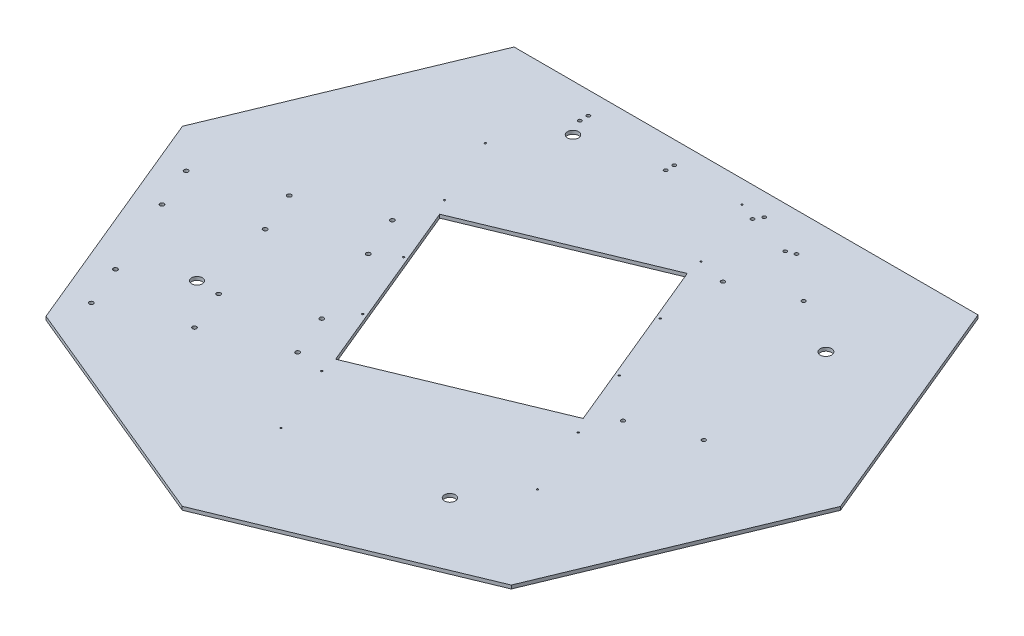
ISO-10303-21;
HEADER;
FILE_DESCRIPTION(('STEP AP214'),'2;1');
FILE_NAME('part.step','',(''),(''),'','','');
FILE_SCHEMA(('AUTOMOTIVE_DESIGN { 1 0 10303 214 1 1 1 1 }'));
ENDSEC;
DATA;
#1=APPLICATION_CONTEXT('core data for automotive mechanical design processes');
#2=APPLICATION_PROTOCOL_DEFINITION('international standard','automotive_design',2000,#1);
#3=PRODUCT_CONTEXT('',#1,'mechanical');
#4=PRODUCT('Part','Part','',(#3));
#5=PRODUCT_RELATED_PRODUCT_CATEGORY('part','',(#4));
#6=PRODUCT_DEFINITION_FORMATION('','',#4);
#7=PRODUCT_DEFINITION_CONTEXT('part definition',#1,'design');
#8=PRODUCT_DEFINITION('design','',#6,#7);
#9=PRODUCT_DEFINITION_SHAPE('','',#8);
#10=(LENGTH_UNIT() NAMED_UNIT(*) SI_UNIT(.MILLI.,.METRE.));
#11=(NAMED_UNIT(*) PLANE_ANGLE_UNIT() SI_UNIT($,.RADIAN.));
#12=(NAMED_UNIT(*) SI_UNIT($,.STERADIAN.) SOLID_ANGLE_UNIT());
#13=UNCERTAINTY_MEASURE_WITH_UNIT(LENGTH_MEASURE(1.E-05),#10,'distance_accuracy_value','');
#14=(GEOMETRIC_REPRESENTATION_CONTEXT(3) GLOBAL_UNCERTAINTY_ASSIGNED_CONTEXT((#13)) GLOBAL_UNIT_ASSIGNED_CONTEXT((#10,
#11,#12)) REPRESENTATION_CONTEXT('',''));
#15=CARTESIAN_POINT('',(0.,0.,0.));
#16=DIRECTION('',(0.,0.,1.));
#17=DIRECTION('',(1.,0.,0.));
#18=AXIS2_PLACEMENT_3D('',#15,#16,#17);
#19=CARTESIAN_POINT('',(53.9331275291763,10.,-617.565557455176));
#20=DIRECTION('',(0.,-1.,0.));
#21=DIRECTION('',(0.,0.,-1.));
#22=AXIS2_PLACEMENT_3D('',#19,#20,#21);
#23=CYLINDRICAL_SURFACE('',#22,2.50000000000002);
#24=CARTESIAN_POINT('',(53.9331275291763,10.,-617.565557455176));
#25=DIRECTION('',(0.,1.,0.));
#26=DIRECTION('',(0.,0.,1.));
#27=AXIS2_PLACEMENT_3D('',#24,#25,#26);
#28=CIRCLE('',#27,2.50000000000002);
#29=CARTESIAN_POINT('',(53.9331275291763,10.,-615.065557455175));
#30=VERTEX_POINT('',#29);
#31=EDGE_CURVE('E40',#30,#30,#28,.T.);
#32=ORIENTED_EDGE('',*,*,#31,.T.);
#33=EDGE_LOOP('',(#32));
#34=FACE_BOUND('',#33,.T.);
#35=CARTESIAN_POINT('',(53.9331275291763,0.,-617.565557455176));
#36=DIRECTION('',(0.,1.,0.));
#37=DIRECTION('',(0.,0.,1.));
#38=AXIS2_PLACEMENT_3D('',#35,#36,#37);
#39=CIRCLE('',#38,2.50000000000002);
#40=CARTESIAN_POINT('',(53.9331275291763,0.,-615.065557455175));
#41=VERTEX_POINT('',#40);
#42=EDGE_CURVE('E11',#41,#41,#39,.T.);
#43=ORIENTED_EDGE('',*,*,#42,.F.);
#44=EDGE_LOOP('',(#43));
#45=FACE_BOUND('',#44,.T.);
#46=ADVANCED_FACE('F33',(#34,#45),#23,.F.);
#47=CARTESIAN_POINT('',(-474.58955439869,10.,-398.824215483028));
#48=DIRECTION('',(0.,-1.,0.));
#49=DIRECTION('',(0.,0.,-1.));
#50=AXIS2_PLACEMENT_3D('',#47,#48,#49);
#51=CYLINDRICAL_SURFACE('',#50,2.5);
#52=CARTESIAN_POINT('',(-474.58955439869,10.,-398.824215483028));
#53=DIRECTION('',(0.,1.,0.));
#54=DIRECTION('',(0.,0.,1.));
#55=AXIS2_PLACEMENT_3D('',#52,#53,#54);
#56=CIRCLE('',#55,2.5);
#57=CARTESIAN_POINT('',(-474.58955439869,10.,-396.324215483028));
#58=VERTEX_POINT('',#57);
#59=EDGE_CURVE('E253',#58,#58,#56,.T.);
#60=ORIENTED_EDGE('',*,*,#59,.T.);
#61=EDGE_LOOP('',(#60));
#62=FACE_BOUND('',#61,.T.);
#63=CARTESIAN_POINT('',(-474.58955439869,0.,-398.824215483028));
#64=DIRECTION('',(0.,1.,0.));
#65=DIRECTION('',(0.,0.,1.));
#66=AXIS2_PLACEMENT_3D('',#63,#64,#65);
#67=CIRCLE('',#66,2.5);
#68=CARTESIAN_POINT('',(-474.58955439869,0.,-396.324215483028));
#69=VERTEX_POINT('',#68);
#70=EDGE_CURVE('E256',#69,#69,#67,.T.);
#71=ORIENTED_EDGE('',*,*,#70,.F.);
#72=EDGE_LOOP('',(#71));
#73=FACE_BOUND('',#72,.T.);
#74=ADVANCED_FACE('F554',(#62,#73),#51,.F.);
#75=CARTESIAN_POINT('',(138.064412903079,10.,-414.287602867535));
#76=DIRECTION('',(0.,-1.,0.));
#77=DIRECTION('',(0.,0.,-1.));
#78=AXIS2_PLACEMENT_3D('',#75,#76,#77);
#79=CYLINDRICAL_SURFACE('',#78,2.50000000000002);
#80=CARTESIAN_POINT('',(138.064412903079,10.,-414.287602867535));
#81=DIRECTION('',(0.,1.,0.));
#82=DIRECTION('',(0.,0.,1.));
#83=AXIS2_PLACEMENT_3D('',#80,#81,#82);
#84=CIRCLE('',#83,2.50000000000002);
#85=CARTESIAN_POINT('',(138.064412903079,10.,-411.787602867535));
#86=VERTEX_POINT('',#85);
#87=EDGE_CURVE('E247',#86,#86,#84,.T.);
#88=ORIENTED_EDGE('',*,*,#87,.T.);
#89=EDGE_LOOP('',(#88));
#90=FACE_BOUND('',#89,.T.);
#91=CARTESIAN_POINT('',(138.064412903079,0.,-414.287602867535));
#92=DIRECTION('',(0.,1.,0.));
#93=DIRECTION('',(0.,0.,1.));
#94=AXIS2_PLACEMENT_3D('',#91,#92,#93);
#95=CIRCLE('',#94,2.50000000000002);
#96=CARTESIAN_POINT('',(138.064412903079,0.,-411.787602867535));
#97=VERTEX_POINT('',#96);
#98=EDGE_CURVE('E250',#97,#97,#95,.T.);
#99=ORIENTED_EDGE('',*,*,#98,.F.);
#100=EDGE_LOOP('',(#99));
#101=FACE_BOUND('',#100,.T.);
#102=ADVANCED_FACE('F558',(#90,#101),#79,.F.);
#103=CARTESIAN_POINT('',(-390.458269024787,10.,-195.546260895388));
#104=DIRECTION('',(0.,-1.,0.));
#105=DIRECTION('',(0.,0.,-1.));
#106=AXIS2_PLACEMENT_3D('',#103,#104,#105);
#107=CYLINDRICAL_SURFACE('',#106,2.5);
#108=CARTESIAN_POINT('',(-390.458269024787,10.,-195.546260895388));
#109=DIRECTION('',(0.,1.,0.));
#110=DIRECTION('',(0.,0.,1.));
#111=AXIS2_PLACEMENT_3D('',#108,#109,#110);
#112=CIRCLE('',#111,2.5);
#113=CARTESIAN_POINT('',(-390.458269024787,10.,-193.046260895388));
#114=VERTEX_POINT('',#113);
#115=EDGE_CURVE('E241',#114,#114,#112,.T.);
#116=ORIENTED_EDGE('',*,*,#115,.T.);
#117=EDGE_LOOP('',(#116));
#118=FACE_BOUND('',#117,.T.);
#119=CARTESIAN_POINT('',(-390.458269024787,0.,-195.546260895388));
#120=DIRECTION('',(0.,1.,0.));
#121=DIRECTION('',(0.,0.,1.));
#122=AXIS2_PLACEMENT_3D('',#119,#120,#121);
#123=CIRCLE('',#122,2.5);
#124=CARTESIAN_POINT('',(-390.458269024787,0.,-193.046260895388));
#125=VERTEX_POINT('',#124);
#126=EDGE_CURVE('E244',#125,#125,#123,.T.);
#127=ORIENTED_EDGE('',*,*,#126,.F.);
#128=EDGE_LOOP('',(#127));
#129=FACE_BOUND('',#128,.T.);
#130=ADVANCED_FACE('F563',(#118,#129),#107,.F.);
#131=CARTESIAN_POINT('',(222.195698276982,10.,-211.009648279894));
#132=DIRECTION('',(0.,-1.,0.));
#133=DIRECTION('',(0.,0.,-1.));
#134=AXIS2_PLACEMENT_3D('',#131,#132,#133);
#135=CYLINDRICAL_SURFACE('',#134,2.50000000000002);
#136=CARTESIAN_POINT('',(222.195698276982,10.,-211.009648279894));
#137=DIRECTION('',(0.,1.,0.));
#138=DIRECTION('',(0.,0.,1.));
#139=AXIS2_PLACEMENT_3D('',#136,#137,#138);
#140=CIRCLE('',#139,2.50000000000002);
#141=CARTESIAN_POINT('',(222.195698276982,10.,-208.509648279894));
#142=VERTEX_POINT('',#141);
#143=EDGE_CURVE('E235',#142,#142,#140,.T.);
#144=ORIENTED_EDGE('',*,*,#143,.T.);
#145=EDGE_LOOP('',(#144));
#146=FACE_BOUND('',#145,.T.);
#147=CARTESIAN_POINT('',(222.195698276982,0.,-211.009648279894));
#148=DIRECTION('',(0.,1.,0.));
#149=DIRECTION('',(0.,0.,1.));
#150=AXIS2_PLACEMENT_3D('',#147,#148,#149);
#151=CIRCLE('',#150,2.50000000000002);
#152=CARTESIAN_POINT('',(222.195698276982,0.,-208.509648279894));
#153=VERTEX_POINT('',#152);
#154=EDGE_CURVE('E238',#153,#153,#151,.T.);
#155=ORIENTED_EDGE('',*,*,#154,.F.);
#156=EDGE_LOOP('',(#155));
#157=FACE_BOUND('',#156,.T.);
#158=ADVANCED_FACE('F570',(#146,#157),#135,.F.);
#159=CARTESIAN_POINT('',(-306.326983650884,10.,7.73169369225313));
#160=DIRECTION('',(0.,-1.,0.));
#161=DIRECTION('',(0.,0.,-1.));
#162=AXIS2_PLACEMENT_3D('',#159,#160,#161);
#163=CYLINDRICAL_SURFACE('',#162,2.5);
#164=CARTESIAN_POINT('',(-306.326983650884,10.,7.73169369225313));
#165=DIRECTION('',(0.,1.,0.));
#166=DIRECTION('',(0.,0.,1.));
#167=AXIS2_PLACEMENT_3D('',#164,#165,#166);
#168=CIRCLE('',#167,2.5);
#169=CARTESIAN_POINT('',(-306.326983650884,10.,10.2316936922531));
#170=VERTEX_POINT('',#169);
#171=EDGE_CURVE('E229',#170,#170,#168,.T.);
#172=ORIENTED_EDGE('',*,*,#171,.T.);
#173=EDGE_LOOP('',(#172));
#174=FACE_BOUND('',#173,.T.);
#175=CARTESIAN_POINT('',(-306.326983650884,0.,7.73169369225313));
#176=DIRECTION('',(0.,1.,0.));
#177=DIRECTION('',(0.,0.,1.));
#178=AXIS2_PLACEMENT_3D('',#175,#176,#177);
#179=CIRCLE('',#178,2.5);
#180=CARTESIAN_POINT('',(-306.326983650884,0.,10.2316936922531));
#181=VERTEX_POINT('',#180);
#182=EDGE_CURVE('E232',#181,#181,#179,.T.);
#183=ORIENTED_EDGE('',*,*,#182,.F.);
#184=EDGE_LOOP('',(#183));
#185=FACE_BOUND('',#184,.T.);
#186=ADVANCED_FACE('F574',(#174,#185),#163,.F.);
#187=CARTESIAN_POINT('',(306.326983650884,10.,-7.73169369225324));
#188=DIRECTION('',(0.,-1.,0.));
#189=DIRECTION('',(0.,0.,-1.));
#190=AXIS2_PLACEMENT_3D('',#187,#188,#189);
#191=CYLINDRICAL_SURFACE('',#190,2.50000000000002);
#192=CARTESIAN_POINT('',(306.326983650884,10.,-7.73169369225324));
#193=DIRECTION('',(0.,1.,0.));
#194=DIRECTION('',(0.,0.,1.));
#195=AXIS2_PLACEMENT_3D('',#192,#193,#194);
#196=CIRCLE('',#195,2.50000000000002);
#197=CARTESIAN_POINT('',(306.326983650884,10.,-5.23169369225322));
#198=VERTEX_POINT('',#197);
#199=EDGE_CURVE('E223',#198,#198,#196,.T.);
#200=ORIENTED_EDGE('',*,*,#199,.T.);
#201=EDGE_LOOP('',(#200));
#202=FACE_BOUND('',#201,.T.);
#203=CARTESIAN_POINT('',(306.326983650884,0.,-7.73169369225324));
#204=DIRECTION('',(0.,1.,0.));
#205=DIRECTION('',(0.,0.,1.));
#206=AXIS2_PLACEMENT_3D('',#203,#204,#205);
#207=CIRCLE('',#206,2.50000000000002);
#208=CARTESIAN_POINT('',(306.326983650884,0.,-5.23169369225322));
#209=VERTEX_POINT('',#208);
#210=EDGE_CURVE('E226',#209,#209,#207,.T.);
#211=ORIENTED_EDGE('',*,*,#210,.F.);
#212=EDGE_LOOP('',(#211));
#213=FACE_BOUND('',#212,.T.);
#214=ADVANCED_FACE('F578',(#202,#213),#191,.F.);
#215=CARTESIAN_POINT('',(-222.195698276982,10.,211.009648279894));
#216=DIRECTION('',(0.,-1.,0.));
#217=DIRECTION('',(0.,0.,-1.));
#218=AXIS2_PLACEMENT_3D('',#215,#216,#217);
#219=CYLINDRICAL_SURFACE('',#218,2.5);
#220=CARTESIAN_POINT('',(-222.195698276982,10.,211.009648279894));
#221=DIRECTION('',(0.,1.,0.));
#222=DIRECTION('',(0.,0.,1.));
#223=AXIS2_PLACEMENT_3D('',#220,#221,#222);
#224=CIRCLE('',#223,2.5);
#225=CARTESIAN_POINT('',(-222.195698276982,10.,213.509648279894));
#226=VERTEX_POINT('',#225);
#227=EDGE_CURVE('E217',#226,#226,#224,.T.);
#228=ORIENTED_EDGE('',*,*,#227,.T.);
#229=EDGE_LOOP('',(#228));
#230=FACE_BOUND('',#229,.T.);
#231=CARTESIAN_POINT('',(-222.195698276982,0.,211.009648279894));
#232=DIRECTION('',(0.,1.,0.));
#233=DIRECTION('',(0.,0.,1.));
#234=AXIS2_PLACEMENT_3D('',#231,#232,#233);
#235=CIRCLE('',#234,2.5);
#236=CARTESIAN_POINT('',(-222.195698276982,0.,213.509648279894));
#237=VERTEX_POINT('',#236);
#238=EDGE_CURVE('E220',#237,#237,#235,.T.);
#239=ORIENTED_EDGE('',*,*,#238,.F.);
#240=EDGE_LOOP('',(#239));
#241=FACE_BOUND('',#240,.T.);
#242=ADVANCED_FACE('F582',(#230,#241),#219,.F.);
#243=CARTESIAN_POINT('',(390.458269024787,10.,195.546260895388));
#244=DIRECTION('',(0.,-1.,0.));
#245=DIRECTION('',(0.,0.,-1.));
#246=AXIS2_PLACEMENT_3D('',#243,#244,#245);
#247=CYLINDRICAL_SURFACE('',#246,2.50000000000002);
#248=CARTESIAN_POINT('',(390.458269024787,10.,195.546260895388));
#249=DIRECTION('',(0.,1.,0.));
#250=DIRECTION('',(0.,0.,1.));
#251=AXIS2_PLACEMENT_3D('',#248,#249,#250);
#252=CIRCLE('',#251,2.50000000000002);
#253=CARTESIAN_POINT('',(390.458269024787,10.,198.046260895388));
#254=VERTEX_POINT('',#253);
#255=EDGE_CURVE('E211',#254,#254,#252,.T.);
#256=ORIENTED_EDGE('',*,*,#255,.T.);
#257=EDGE_LOOP('',(#256));
#258=FACE_BOUND('',#257,.T.);
#259=CARTESIAN_POINT('',(390.458269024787,0.,195.546260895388));
#260=DIRECTION('',(0.,1.,0.));
#261=DIRECTION('',(0.,0.,1.));
#262=AXIS2_PLACEMENT_3D('',#259,#260,#261);
#263=CIRCLE('',#262,2.50000000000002);
#264=CARTESIAN_POINT('',(390.458269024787,0.,198.046260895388));
#265=VERTEX_POINT('',#264);
#266=EDGE_CURVE('E214',#265,#265,#263,.T.);
#267=ORIENTED_EDGE('',*,*,#266,.F.);
#268=EDGE_LOOP('',(#267));
#269=FACE_BOUND('',#268,.T.);
#270=ADVANCED_FACE('F586',(#258,#269),#247,.F.);
#271=CARTESIAN_POINT('',(-138.064412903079,10.,414.287602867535));
#272=DIRECTION('',(0.,-1.,0.));
#273=DIRECTION('',(0.,0.,-1.));
#274=AXIS2_PLACEMENT_3D('',#271,#272,#273);
#275=CYLINDRICAL_SURFACE('',#274,2.5);
#276=CARTESIAN_POINT('',(-138.064412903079,10.,414.287602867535));
#277=DIRECTION('',(0.,1.,0.));
#278=DIRECTION('',(0.,0.,1.));
#279=AXIS2_PLACEMENT_3D('',#276,#277,#278);
#280=CIRCLE('',#279,2.5);
#281=CARTESIAN_POINT('',(-138.064412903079,10.,416.787602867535));
#282=VERTEX_POINT('',#281);
#283=EDGE_CURVE('E205',#282,#282,#280,.T.);
#284=ORIENTED_EDGE('',*,*,#283,.T.);
#285=EDGE_LOOP('',(#284));
#286=FACE_BOUND('',#285,.T.);
#287=CARTESIAN_POINT('',(-138.064412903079,0.,414.287602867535));
#288=DIRECTION('',(0.,1.,0.));
#289=DIRECTION('',(0.,0.,1.));
#290=AXIS2_PLACEMENT_3D('',#287,#288,#289);
#291=CIRCLE('',#290,2.5);
#292=CARTESIAN_POINT('',(-138.064412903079,0.,416.787602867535));
#293=VERTEX_POINT('',#292);
#294=EDGE_CURVE('E208',#293,#293,#291,.T.);
#295=ORIENTED_EDGE('',*,*,#294,.F.);
#296=EDGE_LOOP('',(#295));
#297=FACE_BOUND('',#296,.T.);
#298=ADVANCED_FACE('F266',(#286,#297),#275,.F.);
#299=CARTESIAN_POINT('',(-1157.41839764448,10.,479.02438661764));
#300=DIRECTION('',(0.,1.,0.));
#301=DIRECTION('',(0.,0.,1.));
#302=AXIS2_PLACEMENT_3D('',#299,#300,#301);
#303=PLANE('',#302);
#304=CARTESIAN_POINT('',(-547.647778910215,10.,368.346424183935));
#305=DIRECTION('',(0.,-1.,0.));
#306=DIRECTION('',(0.,0.,-1.));
#307=AXIS2_PLACEMENT_3D('',#304,#305,#306);
#308=CIRCLE('',#307,15.4654739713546);
#309=CARTESIAN_POINT('',(-547.647778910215,10.,352.88095021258));
#310=VERTEX_POINT('',#309);
#311=EDGE_CURVE('E983',#310,#310,#308,.T.);
#312=ORIENTED_EDGE('',*,*,#311,.T.);
#313=EDGE_LOOP('',(#312));
#314=FACE_BOUND('',#313,.T.);
#315=CARTESIAN_POINT('',(368.34642418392,10.,547.647778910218));
#316=DIRECTION('',(0.,-1.,0.));
#317=DIRECTION('',(0.,0.,-1.));
#318=AXIS2_PLACEMENT_3D('',#315,#316,#317);
#319=CIRCLE('',#318,15.7638182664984);
#320=CARTESIAN_POINT('',(368.34642418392,10.,531.88396064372));
#321=VERTEX_POINT('',#320);
#322=EDGE_CURVE('E991',#321,#321,#319,.T.);
#323=ORIENTED_EDGE('',*,*,#322,.T.);
#324=EDGE_LOOP('',(#323));
#325=FACE_BOUND('',#324,.T.);
#326=CARTESIAN_POINT('',(547.647778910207,10.,-368.34642418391));
#327=DIRECTION('',(0.,-1.,0.));
#328=DIRECTION('',(0.,0.,-1.));
#329=AXIS2_PLACEMENT_3D('',#326,#327,#328);
#330=CIRCLE('',#329,16.4374157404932);
#331=CARTESIAN_POINT('',(547.647778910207,10.,-384.783839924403));
#332=VERTEX_POINT('',#331);
#333=EDGE_CURVE('E997',#332,#332,#330,.T.);
#334=ORIENTED_EDGE('',*,*,#333,.T.);
#335=EDGE_LOOP('',(#334));
#336=FACE_BOUND('',#335,.T.);
#337=CARTESIAN_POINT('',(-368.346424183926,10.,-547.6477789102));
#338=DIRECTION('',(0.,-1.,0.));
#339=DIRECTION('',(0.,0.,-1.));
#340=AXIS2_PLACEMENT_3D('',#337,#338,#339);
#341=CIRCLE('',#340,16.);
#342=CARTESIAN_POINT('',(-368.346424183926,10.,-563.6477789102));
#343=VERTEX_POINT('',#342);
#344=EDGE_CURVE('E428',#343,#343,#341,.T.);
#345=ORIENTED_EDGE('',*,*,#344,.T.);
#346=EDGE_LOOP('',(#345));
#347=FACE_BOUND('',#346,.T.);
#348=ORIENTED_EDGE('',*,*,#59,.F.);
#349=EDGE_LOOP('',(#348));
#350=FACE_BOUND('',#349,.T.);
#351=ORIENTED_EDGE('',*,*,#31,.F.);
#352=EDGE_LOOP('',(#351));
#353=FACE_BOUND('',#352,.T.);
#354=ORIENTED_EDGE('',*,*,#115,.F.);
#355=EDGE_LOOP('',(#354));
#356=FACE_BOUND('',#355,.T.);
#357=ORIENTED_EDGE('',*,*,#87,.F.);
#358=EDGE_LOOP('',(#357));
#359=FACE_BOUND('',#358,.T.);
#360=ORIENTED_EDGE('',*,*,#171,.F.);
#361=EDGE_LOOP('',(#360));
#362=FACE_BOUND('',#361,.T.);
#363=ORIENTED_EDGE('',*,*,#143,.F.);
#364=EDGE_LOOP('',(#363));
#365=FACE_BOUND('',#364,.T.);
#366=ORIENTED_EDGE('',*,*,#227,.F.);
#367=EDGE_LOOP('',(#366));
#368=FACE_BOUND('',#367,.T.);
#369=ORIENTED_EDGE('',*,*,#199,.F.);
#370=EDGE_LOOP('',(#369));
#371=FACE_BOUND('',#370,.T.);
#372=ORIENTED_EDGE('',*,*,#283,.F.);
#373=EDGE_LOOP('',(#372));
#374=FACE_BOUND('',#373,.T.);
#375=ORIENTED_EDGE('',*,*,#255,.F.);
#376=EDGE_LOOP('',(#375));
#377=FACE_BOUND('',#376,.T.);
#378=CARTESIAN_POINT('',(-394.,10.,-593.27860786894));
#379=DIRECTION('',(0.,1.,0.));
#380=DIRECTION('',(0.,0.,1.));
#381=AXIS2_PLACEMENT_3D('',#378,#379,#380);
#382=CIRCLE('',#381,4.99999999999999);
#383=CARTESIAN_POINT('',(-394.,10.,-588.27860786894));
#384=VERTEX_POINT('',#383);
#385=EDGE_CURVE('E288',#384,#384,#382,.T.);
#386=ORIENTED_EDGE('',*,*,#385,.F.);
#387=EDGE_LOOP('',(#386));
#388=FACE_BOUND('',#387,.T.);
#389=CARTESIAN_POINT('',(-144.,10.,-618.27860786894));
#390=DIRECTION('',(0.,1.,0.));
#391=DIRECTION('',(0.,0.,1.));
#392=AXIS2_PLACEMENT_3D('',#389,#390,#391);
#393=CIRCLE('',#392,4.99999999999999);
#394=CARTESIAN_POINT('',(-144.,10.,-613.27860786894));
#395=VERTEX_POINT('',#394);
#396=EDGE_CURVE('E292',#395,#395,#393,.T.);
#397=ORIENTED_EDGE('',*,*,#396,.F.);
#398=EDGE_LOOP('',(#397));
#399=FACE_BOUND('',#398,.T.);
#400=CARTESIAN_POINT('',(118.,10.,-618.27860786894));
#401=DIRECTION('',(0.,1.,0.));
#402=DIRECTION('',(0.,0.,1.));
#403=AXIS2_PLACEMENT_3D('',#400,#401,#402);
#404=CIRCLE('',#403,5.00000000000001);
#405=CARTESIAN_POINT('',(118.,10.,-613.27860786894));
#406=VERTEX_POINT('',#405);
#407=EDGE_CURVE('E296',#406,#406,#404,.T.);
#408=ORIENTED_EDGE('',*,*,#407,.F.);
#409=EDGE_LOOP('',(#408));
#410=FACE_BOUND('',#409,.T.);
#411=CARTESIAN_POINT('',(257.876429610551,10.,-572.430182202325));
#412=DIRECTION('',(0.,1.,0.));
#413=DIRECTION('',(0.,0.,1.));
#414=AXIS2_PLACEMENT_3D('',#411,#412,#413);
#415=CIRCLE('',#414,4.99999999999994);
#416=CARTESIAN_POINT('',(257.876429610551,10.,-567.430182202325));
#417=VERTEX_POINT('',#416);
#418=EDGE_CURVE('E300',#417,#417,#415,.T.);
#419=ORIENTED_EDGE('',*,*,#418,.F.);
#420=EDGE_LOOP('',(#419));
#421=FACE_BOUND('',#420,.T.);
#422=CARTESIAN_POINT('',(474.58955439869,10.,398.824215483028));
#423=DIRECTION('',(0.,1.,0.));
#424=DIRECTION('',(0.,0.,1.));
#425=AXIS2_PLACEMENT_3D('',#422,#423,#424);
#426=CIRCLE('',#425,2.50000000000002);
#427=CARTESIAN_POINT('',(474.58955439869,10.,401.324215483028));
#428=VERTEX_POINT('',#427);
#429=EDGE_CURVE('E304',#428,#428,#426,.T.);
#430=ORIENTED_EDGE('',*,*,#429,.F.);
#431=EDGE_LOOP('',(#430));
#432=FACE_BOUND('',#431,.T.);
#433=CARTESIAN_POINT('',(-645.731912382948,10.,578.149036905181));
#434=DIRECTION('',(0.,1.,0.));
#435=DIRECTION('',(0.,0.,1.));
#436=AXIS2_PLACEMENT_3D('',#433,#434,#435);
#437=CIRCLE('',#436,5.99999999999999);
#438=CARTESIAN_POINT('',(-645.731912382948,10.,584.149036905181));
#439=VERTEX_POINT('',#438);
#440=EDGE_CURVE('E308',#439,#439,#437,.T.);
#441=ORIENTED_EDGE('',*,*,#440,.F.);
#442=EDGE_LOOP('',(#441));
#443=FACE_BOUND('',#442,.T.);
#444=CARTESIAN_POINT('',(-220.696189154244,10.,402.238167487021));
#445=DIRECTION('',(0.,1.,0.));
#446=DIRECTION('',(0.,0.,1.));
#447=AXIS2_PLACEMENT_3D('',#444,#445,#446);
#448=CIRCLE('',#447,6.00000000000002);
#449=CARTESIAN_POINT('',(-220.696189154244,10.,408.238167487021));
#450=VERTEX_POINT('',#449);
#451=EDGE_CURVE('E312',#450,#450,#448,.T.);
#452=ORIENTED_EDGE('',*,*,#451,.F.);
#453=EDGE_LOOP('',(#452));
#454=FACE_BOUND('',#453,.T.);
#455=CARTESIAN_POINT('',(-366.013863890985,10.,51.1217004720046));
#456=DIRECTION('',(0.,1.,0.));
#457=DIRECTION('',(0.,0.,1.));
#458=AXIS2_PLACEMENT_3D('',#455,#456,#457);
#459=CIRCLE('',#458,5.99999999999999);
#460=CARTESIAN_POINT('',(-366.013863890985,10.,57.1217004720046));
#461=VERTEX_POINT('',#460);
#462=EDGE_CURVE('E316',#461,#461,#459,.T.);
#463=ORIENTED_EDGE('',*,*,#462,.F.);
#464=EDGE_LOOP('',(#463));
#465=FACE_BOUND('',#464,.T.);
#466=CARTESIAN_POINT('',(-628.245666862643,10.,18.9583438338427));
#467=DIRECTION('',(0.,1.,0.));
#468=DIRECTION('',(0.,0.,1.));
#469=AXIS2_PLACEMENT_3D('',#466,#467,#468);
#470=CIRCLE('',#469,5.99999999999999);
#471=CARTESIAN_POINT('',(-628.245666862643,10.,24.9583438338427));
#472=VERTEX_POINT('',#471);
#473=EDGE_CURVE('E320',#472,#472,#470,.T.);
#474=ORIENTED_EDGE('',*,*,#473,.F.);
#475=EDGE_LOOP('',(#474));
#476=FACE_BOUND('',#475,.T.);
#477=CARTESIAN_POINT('',(-791.049587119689,10.,227.032569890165));
#478=DIRECTION('',(0.,1.,0.));
#479=DIRECTION('',(0.,0.,1.));
#480=AXIS2_PLACEMENT_3D('',#477,#478,#479);
#481=CIRCLE('',#480,5.99999999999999);
#482=CARTESIAN_POINT('',(-791.049587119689,10.,233.032569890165));
#483=VERTEX_POINT('',#482);
#484=EDGE_CURVE('E324',#483,#483,#481,.T.);
#485=ORIENTED_EDGE('',*,*,#484,.F.);
#486=EDGE_LOOP('',(#485));
#487=FACE_BOUND('',#486,.T.);
#488=CARTESIAN_POINT('',(-578.531725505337,10.,139.077135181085));
#489=DIRECTION('',(0.,1.,0.));
#490=DIRECTION('',(0.,0.,1.));
#491=AXIS2_PLACEMENT_3D('',#488,#489,#490);
#492=CIRCLE('',#491,5.99999999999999);
#493=CARTESIAN_POINT('',(-578.531725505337,10.,145.077135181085));
#494=VERTEX_POINT('',#493);
#495=EDGE_CURVE('E328',#494,#494,#492,.T.);
#496=ORIENTED_EDGE('',*,*,#495,.F.);
#497=EDGE_LOOP('',(#496));
#498=FACE_BOUND('',#497,.T.);
#499=CARTESIAN_POINT('',(592.233248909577,10.,31.9496304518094));
#500=DIRECTION('',(0.,1.,0.));
#501=DIRECTION('',(0.,0.,1.));
#502=AXIS2_PLACEMENT_3D('',#499,#500,#501);
#503=CIRCLE('',#502,5.49999999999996);
#504=CARTESIAN_POINT('',(592.233248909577,10.,37.4496304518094));
#505=VERTEX_POINT('',#504);
#506=EDGE_CURVE('E332',#505,#505,#503,.T.);
#507=ORIENTED_EDGE('',*,*,#506,.F.);
#508=EDGE_LOOP('',(#507));
#509=FACE_BOUND('',#508,.T.);
#510=CARTESIAN_POINT('',(386.876429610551,10.,-464.233376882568));
#511=DIRECTION('',(0.,1.,0.));
#512=DIRECTION('',(0.,0.,1.));
#513=AXIS2_PLACEMENT_3D('',#510,#511,#512);
#514=CIRCLE('',#513,5.50000000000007);
#515=CARTESIAN_POINT('',(386.876429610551,10.,-458.733376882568));
#516=VERTEX_POINT('',#515);
#517=EDGE_CURVE('E145',#516,#516,#514,.T.);
#518=ORIENTED_EDGE('',*,*,#517,.F.);
#519=EDGE_LOOP('',(#518));
#520=FACE_BOUND('',#519,.T.);
#521=DIRECTION('',(-0.382951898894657,0.,0.923768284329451));
#522=VECTOR('',#521,1.);
#523=CARTESIAN_POINT('',(-675.580964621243,10.,-683.27860786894));
#524=LINE('',#523,#522);
#525=CARTESIAN_POINT('',(-675.580964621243,10.,-683.27860786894));
#526=VERTEX_POINT('',#525);
#527=CARTESIAN_POINT('',(-958.72139213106,10.,-0.278607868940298));
#528=VERTEX_POINT('',#527);
#529=EDGE_CURVE('E155',#526,#528,#524,.T.);
#530=ORIENTED_EDGE('',*,*,#529,.T.);
#531=DIRECTION('',(0.38241493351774,0.,0.923990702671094));
#532=VECTOR('',#531,1.);
#533=CARTESIAN_POINT('',(-958.72139213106,10.,-0.278607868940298));
#534=LINE('',#533,#532);
#535=CARTESIAN_POINT('',(-678.115403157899,10.,677.72139213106));
#536=VERTEX_POINT('',#535);
#537=EDGE_CURVE('E158',#528,#536,#534,.T.);
#538=ORIENTED_EDGE('',*,*,#537,.T.);
#539=DIRECTION('',(0.92376828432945,0.,0.382951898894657));
#540=VECTOR('',#539,1.);
#541=CARTESIAN_POINT('',(-678.115403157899,10.,677.72139213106));
#542=LINE('',#541,#540);
#543=CARTESIAN_POINT('',(-0.278607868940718,10.,958.72139213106));
#544=VERTEX_POINT('',#543);
#545=EDGE_CURVE('E161',#536,#544,#542,.T.);
#546=ORIENTED_EDGE('',*,*,#545,.T.);
#547=DIRECTION('',(0.923990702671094,0.,-0.38241493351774));
#548=VECTOR('',#547,1.);
#549=CARTESIAN_POINT('',(-0.278607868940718,10.,958.72139213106));
#550=LINE('',#549,#548);
#551=CARTESIAN_POINT('',(677.721392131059,10.,678.1154031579));
#552=VERTEX_POINT('',#551);
#553=EDGE_CURVE('E163',#544,#552,#550,.T.);
#554=ORIENTED_EDGE('',*,*,#553,.T.);
#555=DIRECTION('',(0.382951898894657,0.,-0.92376828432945));
#556=VECTOR('',#555,1.);
#557=CARTESIAN_POINT('',(677.721392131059,10.,678.1154031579));
#558=LINE('',#557,#556);
#559=CARTESIAN_POINT('',(958.72139213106,10.,0.278607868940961));
#560=VERTEX_POINT('',#559);
#561=EDGE_CURVE('E165',#552,#560,#558,.T.);
#562=ORIENTED_EDGE('',*,*,#561,.T.);
#563=DIRECTION('',(-0.38241493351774,0.,-0.923990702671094));
#564=VECTOR('',#563,1.);
#565=CARTESIAN_POINT('',(958.72139213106,10.,0.278607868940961));
#566=LINE('',#565,#564);
#567=CARTESIAN_POINT('',(675.81542083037,10.,-683.27860786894));
#568=VERTEX_POINT('',#567);
#569=EDGE_CURVE('E167',#560,#568,#566,.T.);
#570=ORIENTED_EDGE('',*,*,#569,.T.);
#571=DIRECTION('',(-1.,0.,0.));
#572=VECTOR('',#571,1.);
#573=CARTESIAN_POINT('',(-675.580964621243,10.,-683.27860786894));
#574=LINE('',#573,#572);
#575=EDGE_CURVE('E169',#568,#526,#574,.T.);
#576=ORIENTED_EDGE('',*,*,#575,.T.);
#577=EDGE_LOOP('',(#530,#538,#546,#554,#562,#570,#576));
#578=FACE_BOUND('',#577,.T.);
#579=DIRECTION('',(-0.38241493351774,0.,-0.923990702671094));
#580=VECTOR('',#579,1.);
#581=CARTESIAN_POINT('',(362.097615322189,10.,153.17087509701));
#582=LINE('',#581,#580);
#583=CARTESIAN_POINT('',(362.097615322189,10.,153.17087509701));
#584=VERTEX_POINT('',#583);
#585=CARTESIAN_POINT('',(147.945252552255,10.,-364.263918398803));
#586=VERTEX_POINT('',#585);
#587=EDGE_CURVE('E123',#584,#586,#582,.T.);
#588=ORIENTED_EDGE('',*,*,#587,.F.);
#589=DIRECTION('',(0.923990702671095,0.,-0.38241493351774));
#590=VECTOR('',#589,1.);
#591=CARTESIAN_POINT('',(-147.945252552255,10.,364.263918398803));
#592=LINE('',#591,#590);
#593=CARTESIAN_POINT('',(-147.945252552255,10.,364.263918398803));
#594=VERTEX_POINT('',#593);
#595=EDGE_CURVE('E115',#594,#584,#592,.T.);
#596=ORIENTED_EDGE('',*,*,#595,.F.);
#597=DIRECTION('',(0.38241493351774,0.,0.923990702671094));
#598=VECTOR('',#597,1.);
#599=CARTESIAN_POINT('',(-147.945252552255,10.,364.263918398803));
#600=LINE('',#599,#598);
#601=CARTESIAN_POINT('',(-362.097615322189,10.,-153.17087509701));
#602=VERTEX_POINT('',#601);
#603=EDGE_CURVE('E139',#602,#594,#600,.T.);
#604=ORIENTED_EDGE('',*,*,#603,.F.);
#605=DIRECTION('',(-0.923990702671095,0.,0.38241493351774));
#606=VECTOR('',#605,1.);
#607=CARTESIAN_POINT('',(-362.097615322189,10.,-153.17087509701));
#608=LINE('',#607,#606);
#609=EDGE_CURVE('E137',#586,#602,#608,.T.);
#610=ORIENTED_EDGE('',*,*,#609,.F.);
#611=EDGE_LOOP('',(#588,#596,#604,#610));
#612=FACE_BOUND('',#611,.T.);
#613=CARTESIAN_POINT('',(220.558103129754,10.,-395.398688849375));
#614=DIRECTION('',(0.,1.,0.));
#615=DIRECTION('',(0.,0.,1.));
#616=AXIS2_PLACEMENT_3D('',#613,#614,#615);
#617=CIRCLE('',#616,5.50000000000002);
#618=CARTESIAN_POINT('',(220.558103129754,10.,-389.898688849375));
#619=VERTEX_POINT('',#618);
#620=EDGE_CURVE('E529',#619,#619,#617,.T.);
#621=ORIENTED_EDGE('',*,*,#620,.F.);
#622=EDGE_LOOP('',(#621));
#623=FACE_BOUND('',#622,.T.);
#624=CARTESIAN_POINT('',(425.91492242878,10.,100.784318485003));
#625=DIRECTION('',(0.,1.,0.));
#626=DIRECTION('',(0.,0.,1.));
#627=AXIS2_PLACEMENT_3D('',#624,#625,#626);
#628=CIRCLE('',#627,5.50000000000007);
#629=CARTESIAN_POINT('',(425.91492242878,10.,106.284318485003));
#630=VERTEX_POINT('',#629);
#631=EDGE_CURVE('E521',#630,#630,#628,.T.);
#632=ORIENTED_EDGE('',*,*,#631,.F.);
#633=EDGE_LOOP('',(#632));
#634=FACE_BOUND('',#633,.T.);
#635=CARTESIAN_POINT('',(-482.927992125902,10.,370.074810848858));
#636=DIRECTION('',(0.,1.,0.));
#637=DIRECTION('',(0.,0.,1.));
#638=AXIS2_PLACEMENT_3D('',#635,#636,#637);
#639=CIRCLE('',#638,5.99999999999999);
#640=CARTESIAN_POINT('',(-482.927992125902,10.,376.074810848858));
#641=VERTEX_POINT('',#640);
#642=EDGE_CURVE('E513',#641,#641,#639,.T.);
#643=ORIENTED_EDGE('',*,*,#642,.F.);
#644=EDGE_LOOP('',(#643));
#645=FACE_BOUND('',#644,.T.);
#646=CARTESIAN_POINT('',(-840.763528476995,10.,106.913778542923));
#647=DIRECTION('',(0.,1.,0.));
#648=DIRECTION('',(0.,0.,1.));
#649=AXIS2_PLACEMENT_3D('',#646,#647,#648);
#650=CIRCLE('',#649,5.99999999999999);
#651=CARTESIAN_POINT('',(-840.763528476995,10.,112.913778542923));
#652=VERTEX_POINT('',#651);
#653=EDGE_CURVE('E505',#652,#652,#650,.T.);
#654=ORIENTED_EDGE('',*,*,#653,.F.);
#655=EDGE_LOOP('',(#654));
#656=FACE_BOUND('',#655,.T.);
#657=CARTESIAN_POINT('',(-415.727805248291,10.,-68.9970908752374));
#658=DIRECTION('',(0.,1.,0.));
#659=DIRECTION('',(0.,0.,1.));
#660=AXIS2_PLACEMENT_3D('',#657,#658,#659);
#661=CIRCLE('',#660,5.99999999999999);
#662=CARTESIAN_POINT('',(-415.727805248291,10.,-62.9970908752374));
#663=VERTEX_POINT('',#662);
#664=EDGE_CURVE('E497',#663,#663,#661,.T.);
#665=ORIENTED_EDGE('',*,*,#664,.F.);
#666=EDGE_LOOP('',(#665));
#667=FACE_BOUND('',#666,.T.);
#668=CARTESIAN_POINT('',(-270.41013051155,10.,282.119376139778));
#669=DIRECTION('',(0.,1.,0.));
#670=DIRECTION('',(0.,0.,1.));
#671=AXIS2_PLACEMENT_3D('',#668,#669,#670);
#672=CIRCLE('',#671,5.99999999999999);
#673=CARTESIAN_POINT('',(-270.41013051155,10.,288.119376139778));
#674=VERTEX_POINT('',#673);
#675=EDGE_CURVE('E489',#674,#674,#672,.T.);
#676=ORIENTED_EDGE('',*,*,#675,.F.);
#677=EDGE_LOOP('',(#676));
#678=FACE_BOUND('',#677,.T.);
#679=CARTESIAN_POINT('',(-433.214050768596,10.,490.193602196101));
#680=DIRECTION('',(0.,1.,0.));
#681=DIRECTION('',(0.,0.,1.));
#682=AXIS2_PLACEMENT_3D('',#679,#680,#681);
#683=CIRCLE('',#682,5.99999999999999);
#684=CARTESIAN_POINT('',(-433.214050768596,10.,496.193602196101));
#685=VERTEX_POINT('',#684);
#686=EDGE_CURVE('E481',#685,#685,#683,.T.);
#687=ORIENTED_EDGE('',*,*,#686,.F.);
#688=EDGE_LOOP('',(#687));
#689=FACE_BOUND('',#688,.T.);
#690=CARTESIAN_POINT('',(-695.445853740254,10.,458.030245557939));
#691=DIRECTION('',(0.,1.,0.));
#692=DIRECTION('',(0.,0.,1.));
#693=AXIS2_PLACEMENT_3D('',#690,#691,#692);
#694=CIRCLE('',#693,5.99999999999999);
#695=CARTESIAN_POINT('',(-695.445853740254,10.,464.030245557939));
#696=VERTEX_POINT('',#695);
#697=EDGE_CURVE('E473',#696,#696,#694,.T.);
#698=ORIENTED_EDGE('',*,*,#697,.F.);
#699=EDGE_LOOP('',(#698));
#700=FACE_BOUND('',#699,.T.);
#701=CARTESIAN_POINT('',(-53.9331275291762,10.,617.565557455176));
#702=DIRECTION('',(0.,1.,0.));
#703=DIRECTION('',(0.,0.,1.));
#704=AXIS2_PLACEMENT_3D('',#701,#702,#703);
#705=CIRCLE('',#704,2.5);
#706=CARTESIAN_POINT('',(-53.9331275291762,10.,620.065557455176));
#707=VERTEX_POINT('',#706);
#708=EDGE_CURVE('E465',#707,#707,#705,.T.);
#709=ORIENTED_EDGE('',*,*,#708,.F.);
#710=EDGE_LOOP('',(#709));
#711=FACE_BOUND('',#710,.T.);
#712=CARTESIAN_POINT('',(234.863808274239,10.,-562.661903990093));
#713=DIRECTION('',(0.,1.,0.));
#714=DIRECTION('',(0.,0.,1.));
#715=AXIS2_PLACEMENT_3D('',#712,#713,#714);
#716=CIRCLE('',#715,4.99999999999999);
#717=CARTESIAN_POINT('',(234.863808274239,10.,-557.661903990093));
#718=VERTEX_POINT('',#717);
#719=EDGE_CURVE('E457',#718,#718,#716,.T.);
#720=ORIENTED_EDGE('',*,*,#719,.F.);
#721=EDGE_LOOP('',(#720));
#722=FACE_BOUND('',#721,.T.);
#723=CARTESIAN_POINT('',(105.499999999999,10.,-596.627972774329));
#724=DIRECTION('',(0.,1.,0.));
#725=DIRECTION('',(0.,0.,1.));
#726=AXIS2_PLACEMENT_3D('',#723,#724,#725);
#727=CIRCLE('',#726,5.00000000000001);
#728=CARTESIAN_POINT('',(105.499999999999,10.,-591.627972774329));
#729=VERTEX_POINT('',#728);
#730=EDGE_CURVE('E449',#729,#729,#727,.T.);
#731=ORIENTED_EDGE('',*,*,#730,.F.);
#732=EDGE_LOOP('',(#731));
#733=FACE_BOUND('',#732,.T.);
#734=CARTESIAN_POINT('',(-144.,10.,-593.27860786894));
#735=DIRECTION('',(0.,1.,0.));
#736=DIRECTION('',(0.,0.,1.));
#737=AXIS2_PLACEMENT_3D('',#734,#735,#736);
#738=CIRCLE('',#737,4.99999999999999);
#739=CARTESIAN_POINT('',(-144.,10.,-588.27860786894));
#740=VERTEX_POINT('',#739);
#741=EDGE_CURVE('E441',#740,#740,#738,.T.);
#742=ORIENTED_EDGE('',*,*,#741,.F.);
#743=EDGE_LOOP('',(#742));
#744=FACE_BOUND('',#743,.T.);
#745=CARTESIAN_POINT('',(-394.,10.,-618.27860786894));
#746=DIRECTION('',(0.,1.,0.));
#747=DIRECTION('',(0.,0.,1.));
#748=AXIS2_PLACEMENT_3D('',#745,#746,#747);
#749=CIRCLE('',#748,4.99999999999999);
#750=CARTESIAN_POINT('',(-394.,10.,-613.27860786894));
#751=VERTEX_POINT('',#750);
#752=EDGE_CURVE('E427',#751,#751,#749,.T.);
#753=ORIENTED_EDGE('',*,*,#752,.F.);
#754=EDGE_LOOP('',(#753));
#755=FACE_BOUND('',#754,.T.);
#756=ADVANCED_FACE('F135',(#314,#325,#336,#347,#350,#353,#356,#359,#362,#365,#368,#371,#374,
#377,#388,#399,#410,#421,#432,#443,#454,#465,#476,#487,#498,#509,#520,#578,#612,#623,#634,#645,
#656,#667,#678,#689,#700,#711,#722,#733,#744,#755),#303,.T.);
#757=CARTESIAN_POINT('',(-1157.41839764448,0.,479.02438661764));
#758=DIRECTION('',(0.,1.,0.));
#759=DIRECTION('',(0.,0.,1.));
#760=AXIS2_PLACEMENT_3D('',#757,#758,#759);
#761=PLANE('',#760);
#762=CARTESIAN_POINT('',(-547.647778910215,0.,368.346424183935));
#763=DIRECTION('',(0.,-1.,0.));
#764=DIRECTION('',(0.,0.,-1.));
#765=AXIS2_PLACEMENT_3D('',#762,#763,#764);
#766=CIRCLE('',#765,15.4654739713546);
#767=CARTESIAN_POINT('',(-547.647778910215,0.,352.88095021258));
#768=VERTEX_POINT('',#767);
#769=EDGE_CURVE('E986',#768,#768,#766,.T.);
#770=ORIENTED_EDGE('',*,*,#769,.F.);
#771=EDGE_LOOP('',(#770));
#772=FACE_BOUND('',#771,.T.);
#773=CARTESIAN_POINT('',(368.34642418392,0.,547.647778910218));
#774=DIRECTION('',(0.,-1.,0.));
#775=DIRECTION('',(0.,0.,-1.));
#776=AXIS2_PLACEMENT_3D('',#773,#774,#775);
#777=CIRCLE('',#776,15.7638182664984);
#778=CARTESIAN_POINT('',(368.34642418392,0.,531.88396064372));
#779=VERTEX_POINT('',#778);
#780=EDGE_CURVE('E988',#779,#779,#777,.T.);
#781=ORIENTED_EDGE('',*,*,#780,.F.);
#782=EDGE_LOOP('',(#781));
#783=FACE_BOUND('',#782,.T.);
#784=CARTESIAN_POINT('',(547.647778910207,0.,-368.34642418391));
#785=DIRECTION('',(0.,-1.,0.));
#786=DIRECTION('',(0.,0.,-1.));
#787=AXIS2_PLACEMENT_3D('',#784,#785,#786);
#788=CIRCLE('',#787,16.4374157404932);
#789=CARTESIAN_POINT('',(547.647778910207,0.,-384.783839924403));
#790=VERTEX_POINT('',#789);
#791=EDGE_CURVE('E994',#790,#790,#788,.T.);
#792=ORIENTED_EDGE('',*,*,#791,.F.);
#793=EDGE_LOOP('',(#792));
#794=FACE_BOUND('',#793,.T.);
#795=CARTESIAN_POINT('',(-368.346424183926,0.,-547.6477789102));
#796=DIRECTION('',(0.,-1.,0.));
#797=DIRECTION('',(0.,0.,-1.));
#798=AXIS2_PLACEMENT_3D('',#795,#796,#797);
#799=CIRCLE('',#798,16.);
#800=CARTESIAN_POINT('',(-368.346424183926,0.,-563.6477789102));
#801=VERTEX_POINT('',#800);
#802=EDGE_CURVE('E434',#801,#801,#799,.T.);
#803=ORIENTED_EDGE('',*,*,#802,.F.);
#804=EDGE_LOOP('',(#803));
#805=FACE_BOUND('',#804,.T.);
#806=ORIENTED_EDGE('',*,*,#70,.T.);
#807=EDGE_LOOP('',(#806));
#808=FACE_BOUND('',#807,.T.);
#809=ORIENTED_EDGE('',*,*,#42,.T.);
#810=EDGE_LOOP('',(#809));
#811=FACE_BOUND('',#810,.T.);
#812=ORIENTED_EDGE('',*,*,#126,.T.);
#813=EDGE_LOOP('',(#812));
#814=FACE_BOUND('',#813,.T.);
#815=ORIENTED_EDGE('',*,*,#98,.T.);
#816=EDGE_LOOP('',(#815));
#817=FACE_BOUND('',#816,.T.);
#818=ORIENTED_EDGE('',*,*,#182,.T.);
#819=EDGE_LOOP('',(#818));
#820=FACE_BOUND('',#819,.T.);
#821=ORIENTED_EDGE('',*,*,#154,.T.);
#822=EDGE_LOOP('',(#821));
#823=FACE_BOUND('',#822,.T.);
#824=ORIENTED_EDGE('',*,*,#238,.T.);
#825=EDGE_LOOP('',(#824));
#826=FACE_BOUND('',#825,.T.);
#827=ORIENTED_EDGE('',*,*,#210,.T.);
#828=EDGE_LOOP('',(#827));
#829=FACE_BOUND('',#828,.T.);
#830=ORIENTED_EDGE('',*,*,#294,.T.);
#831=EDGE_LOOP('',(#830));
#832=FACE_BOUND('',#831,.T.);
#833=ORIENTED_EDGE('',*,*,#266,.T.);
#834=EDGE_LOOP('',(#833));
#835=FACE_BOUND('',#834,.T.);
#836=CARTESIAN_POINT('',(-394.,0.,-593.27860786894));
#837=DIRECTION('',(0.,1.,0.));
#838=DIRECTION('',(0.,0.,1.));
#839=AXIS2_PLACEMENT_3D('',#836,#837,#838);
#840=CIRCLE('',#839,4.99999999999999);
#841=CARTESIAN_POINT('',(-394.,0.,-588.27860786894));
#842=VERTEX_POINT('',#841);
#843=EDGE_CURVE('E431',#842,#842,#840,.T.);
#844=ORIENTED_EDGE('',*,*,#843,.T.);
#845=EDGE_LOOP('',(#844));
#846=FACE_BOUND('',#845,.T.);
#847=CARTESIAN_POINT('',(-144.,0.,-618.27860786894));
#848=DIRECTION('',(0.,1.,0.));
#849=DIRECTION('',(0.,0.,1.));
#850=AXIS2_PLACEMENT_3D('',#847,#848,#849);
#851=CIRCLE('',#850,4.99999999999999);
#852=CARTESIAN_POINT('',(-144.,0.,-613.27860786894));
#853=VERTEX_POINT('',#852);
#854=EDGE_CURVE('E444',#853,#853,#851,.T.);
#855=ORIENTED_EDGE('',*,*,#854,.T.);
#856=EDGE_LOOP('',(#855));
#857=FACE_BOUND('',#856,.T.);
#858=CARTESIAN_POINT('',(118.,0.,-618.27860786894));
#859=DIRECTION('',(0.,1.,0.));
#860=DIRECTION('',(0.,0.,1.));
#861=AXIS2_PLACEMENT_3D('',#858,#859,#860);
#862=CIRCLE('',#861,5.00000000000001);
#863=CARTESIAN_POINT('',(118.,0.,-613.27860786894));
#864=VERTEX_POINT('',#863);
#865=EDGE_CURVE('E452',#864,#864,#862,.T.);
#866=ORIENTED_EDGE('',*,*,#865,.T.);
#867=EDGE_LOOP('',(#866));
#868=FACE_BOUND('',#867,.T.);
#869=CARTESIAN_POINT('',(257.876429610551,0.,-572.430182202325));
#870=DIRECTION('',(0.,1.,0.));
#871=DIRECTION('',(0.,0.,1.));
#872=AXIS2_PLACEMENT_3D('',#869,#870,#871);
#873=CIRCLE('',#872,4.99999999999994);
#874=CARTESIAN_POINT('',(257.876429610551,0.,-567.430182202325));
#875=VERTEX_POINT('',#874);
#876=EDGE_CURVE('E460',#875,#875,#873,.T.);
#877=ORIENTED_EDGE('',*,*,#876,.T.);
#878=EDGE_LOOP('',(#877));
#879=FACE_BOUND('',#878,.T.);
#880=CARTESIAN_POINT('',(474.58955439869,0.,398.824215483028));
#881=DIRECTION('',(0.,1.,0.));
#882=DIRECTION('',(0.,0.,1.));
#883=AXIS2_PLACEMENT_3D('',#880,#881,#882);
#884=CIRCLE('',#883,2.50000000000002);
#885=CARTESIAN_POINT('',(474.58955439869,0.,401.324215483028));
#886=VERTEX_POINT('',#885);
#887=EDGE_CURVE('E468',#886,#886,#884,.T.);
#888=ORIENTED_EDGE('',*,*,#887,.T.);
#889=EDGE_LOOP('',(#888));
#890=FACE_BOUND('',#889,.T.);
#891=CARTESIAN_POINT('',(-645.731912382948,0.,578.149036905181));
#892=DIRECTION('',(0.,1.,0.));
#893=DIRECTION('',(0.,0.,1.));
#894=AXIS2_PLACEMENT_3D('',#891,#892,#893);
#895=CIRCLE('',#894,5.99999999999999);
#896=CARTESIAN_POINT('',(-645.731912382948,0.,584.149036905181));
#897=VERTEX_POINT('',#896);
#898=EDGE_CURVE('E476',#897,#897,#895,.T.);
#899=ORIENTED_EDGE('',*,*,#898,.T.);
#900=EDGE_LOOP('',(#899));
#901=FACE_BOUND('',#900,.T.);
#902=CARTESIAN_POINT('',(-220.696189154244,0.,402.238167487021));
#903=DIRECTION('',(0.,1.,0.));
#904=DIRECTION('',(0.,0.,1.));
#905=AXIS2_PLACEMENT_3D('',#902,#903,#904);
#906=CIRCLE('',#905,6.00000000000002);
#907=CARTESIAN_POINT('',(-220.696189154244,0.,408.238167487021));
#908=VERTEX_POINT('',#907);
#909=EDGE_CURVE('E484',#908,#908,#906,.T.);
#910=ORIENTED_EDGE('',*,*,#909,.T.);
#911=EDGE_LOOP('',(#910));
#912=FACE_BOUND('',#911,.T.);
#913=CARTESIAN_POINT('',(-366.013863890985,0.,51.1217004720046));
#914=DIRECTION('',(0.,1.,0.));
#915=DIRECTION('',(0.,0.,1.));
#916=AXIS2_PLACEMENT_3D('',#913,#914,#915);
#917=CIRCLE('',#916,5.99999999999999);
#918=CARTESIAN_POINT('',(-366.013863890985,0.,57.1217004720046));
#919=VERTEX_POINT('',#918);
#920=EDGE_CURVE('E492',#919,#919,#917,.T.);
#921=ORIENTED_EDGE('',*,*,#920,.T.);
#922=EDGE_LOOP('',(#921));
#923=FACE_BOUND('',#922,.T.);
#924=CARTESIAN_POINT('',(-628.245666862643,0.,18.9583438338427));
#925=DIRECTION('',(0.,1.,0.));
#926=DIRECTION('',(0.,0.,1.));
#927=AXIS2_PLACEMENT_3D('',#924,#925,#926);
#928=CIRCLE('',#927,5.99999999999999);
#929=CARTESIAN_POINT('',(-628.245666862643,0.,24.9583438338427));
#930=VERTEX_POINT('',#929);
#931=EDGE_CURVE('E500',#930,#930,#928,.T.);
#932=ORIENTED_EDGE('',*,*,#931,.T.);
#933=EDGE_LOOP('',(#932));
#934=FACE_BOUND('',#933,.T.);
#935=CARTESIAN_POINT('',(-791.049587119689,0.,227.032569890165));
#936=DIRECTION('',(0.,1.,0.));
#937=DIRECTION('',(0.,0.,1.));
#938=AXIS2_PLACEMENT_3D('',#935,#936,#937);
#939=CIRCLE('',#938,5.99999999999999);
#940=CARTESIAN_POINT('',(-791.049587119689,0.,233.032569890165));
#941=VERTEX_POINT('',#940);
#942=EDGE_CURVE('E508',#941,#941,#939,.T.);
#943=ORIENTED_EDGE('',*,*,#942,.T.);
#944=EDGE_LOOP('',(#943));
#945=FACE_BOUND('',#944,.T.);
#946=CARTESIAN_POINT('',(-578.531725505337,0.,139.077135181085));
#947=DIRECTION('',(0.,1.,0.));
#948=DIRECTION('',(0.,0.,1.));
#949=AXIS2_PLACEMENT_3D('',#946,#947,#948);
#950=CIRCLE('',#949,5.99999999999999);
#951=CARTESIAN_POINT('',(-578.531725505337,0.,145.077135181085));
#952=VERTEX_POINT('',#951);
#953=EDGE_CURVE('E516',#952,#952,#950,.T.);
#954=ORIENTED_EDGE('',*,*,#953,.T.);
#955=EDGE_LOOP('',(#954));
#956=FACE_BOUND('',#955,.T.);
#957=CARTESIAN_POINT('',(592.233248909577,0.,31.9496304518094));
#958=DIRECTION('',(0.,1.,0.));
#959=DIRECTION('',(0.,0.,1.));
#960=AXIS2_PLACEMENT_3D('',#957,#958,#959);
#961=CIRCLE('',#960,5.49999999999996);
#962=CARTESIAN_POINT('',(592.233248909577,0.,37.4496304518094));
#963=VERTEX_POINT('',#962);
#964=EDGE_CURVE('E524',#963,#963,#961,.T.);
#965=ORIENTED_EDGE('',*,*,#964,.T.);
#966=EDGE_LOOP('',(#965));
#967=FACE_BOUND('',#966,.T.);
#968=CARTESIAN_POINT('',(386.876429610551,0.,-464.233376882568));
#969=DIRECTION('',(0.,1.,0.));
#970=DIRECTION('',(0.,0.,1.));
#971=AXIS2_PLACEMENT_3D('',#968,#969,#970);
#972=CIRCLE('',#971,5.50000000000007);
#973=CARTESIAN_POINT('',(386.876429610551,0.,-458.733376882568));
#974=VERTEX_POINT('',#973);
#975=EDGE_CURVE('E532',#974,#974,#972,.T.);
#976=ORIENTED_EDGE('',*,*,#975,.T.);
#977=EDGE_LOOP('',(#976));
#978=FACE_BOUND('',#977,.T.);
#979=DIRECTION('',(-0.382951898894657,0.,0.923768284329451));
#980=VECTOR('',#979,1.);
#981=CARTESIAN_POINT('',(-675.580964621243,0.,-683.27860786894));
#982=LINE('',#981,#980);
#983=CARTESIAN_POINT('',(-675.580964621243,0.,-683.27860786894));
#984=VERTEX_POINT('',#983);
#985=CARTESIAN_POINT('',(-958.72139213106,0.,-0.278607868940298));
#986=VERTEX_POINT('',#985);
#987=EDGE_CURVE('E131',#984,#986,#982,.T.);
#988=ORIENTED_EDGE('',*,*,#987,.F.);
#989=DIRECTION('',(-1.,0.,0.));
#990=VECTOR('',#989,1.);
#991=CARTESIAN_POINT('',(-675.580964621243,0.,-683.27860786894));
#992=LINE('',#991,#990);
#993=CARTESIAN_POINT('',(675.81542083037,0.,-683.27860786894));
#994=VERTEX_POINT('',#993);
#995=EDGE_CURVE('E159',#994,#984,#992,.T.);
#996=ORIENTED_EDGE('',*,*,#995,.F.);
#997=DIRECTION('',(-0.38241493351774,0.,-0.923990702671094));
#998=VECTOR('',#997,1.);
#999=CARTESIAN_POINT('',(958.72139213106,0.,0.278607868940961));
#1000=LINE('',#999,#998);
#1001=CARTESIAN_POINT('',(958.72139213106,0.,0.278607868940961));
#1002=VERTEX_POINT('',#1001);
#1003=EDGE_CURVE('E182',#1002,#994,#1000,.T.);
#1004=ORIENTED_EDGE('',*,*,#1003,.F.);
#1005=DIRECTION('',(0.382951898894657,0.,-0.92376828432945));
#1006=VECTOR('',#1005,1.);
#1007=CARTESIAN_POINT('',(677.721392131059,0.,678.1154031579));
#1008=LINE('',#1007,#1006);
#1009=CARTESIAN_POINT('',(677.721392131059,0.,678.1154031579));
#1010=VERTEX_POINT('',#1009);
#1011=EDGE_CURVE('E180',#1010,#1002,#1008,.T.);
#1012=ORIENTED_EDGE('',*,*,#1011,.F.);
#1013=DIRECTION('',(0.923990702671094,0.,-0.38241493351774));
#1014=VECTOR('',#1013,1.);
#1015=CARTESIAN_POINT('',(-0.278607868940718,0.,958.72139213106));
#1016=LINE('',#1015,#1014);
#1017=CARTESIAN_POINT('',(-0.278607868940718,0.,958.72139213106));
#1018=VERTEX_POINT('',#1017);
#1019=EDGE_CURVE('E178',#1018,#1010,#1016,.T.);
#1020=ORIENTED_EDGE('',*,*,#1019,.F.);
#1021=DIRECTION('',(0.92376828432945,0.,0.382951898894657));
#1022=VECTOR('',#1021,1.);
#1023=CARTESIAN_POINT('',(-678.115403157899,0.,677.72139213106));
#1024=LINE('',#1023,#1022);
#1025=CARTESIAN_POINT('',(-678.115403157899,0.,677.72139213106));
#1026=VERTEX_POINT('',#1025);
#1027=EDGE_CURVE('E176',#1026,#1018,#1024,.T.);
#1028=ORIENTED_EDGE('',*,*,#1027,.F.);
#1029=DIRECTION('',(0.38241493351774,0.,0.923990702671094));
#1030=VECTOR('',#1029,1.);
#1031=CARTESIAN_POINT('',(-958.72139213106,0.,-0.278607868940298));
#1032=LINE('',#1031,#1030);
#1033=EDGE_CURVE('E174',#986,#1026,#1032,.T.);
#1034=ORIENTED_EDGE('',*,*,#1033,.F.);
#1035=EDGE_LOOP('',(#988,#996,#1004,#1012,#1020,#1028,#1034));
#1036=FACE_BOUND('',#1035,.T.);
#1037=DIRECTION('',(0.923990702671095,0.,-0.38241493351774));
#1038=VECTOR('',#1037,1.);
#1039=CARTESIAN_POINT('',(-147.945252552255,0.,364.263918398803));
#1040=LINE('',#1039,#1038);
#1041=CARTESIAN_POINT('',(-147.945252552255,0.,364.263918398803));
#1042=VERTEX_POINT('',#1041);
#1043=CARTESIAN_POINT('',(362.097615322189,0.,153.17087509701));
#1044=VERTEX_POINT('',#1043);
#1045=EDGE_CURVE('E55',#1042,#1044,#1040,.T.);
#1046=ORIENTED_EDGE('',*,*,#1045,.T.);
#1047=DIRECTION('',(-0.38241493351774,0.,-0.923990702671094));
#1048=VECTOR('',#1047,1.);
#1049=CARTESIAN_POINT('',(362.097615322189,0.,153.17087509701));
#1050=LINE('',#1049,#1048);
#1051=CARTESIAN_POINT('',(147.945252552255,0.,-364.263918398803));
#1052=VERTEX_POINT('',#1051);
#1053=EDGE_CURVE('E130',#1044,#1052,#1050,.T.);
#1054=ORIENTED_EDGE('',*,*,#1053,.T.);
#1055=DIRECTION('',(-0.923990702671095,0.,0.38241493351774));
#1056=VECTOR('',#1055,1.);
#1057=CARTESIAN_POINT('',(-362.097615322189,0.,-153.17087509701));
#1058=LINE('',#1057,#1056);
#1059=CARTESIAN_POINT('',(-362.097615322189,0.,-153.17087509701));
#1060=VERTEX_POINT('',#1059);
#1061=EDGE_CURVE('E147',#1052,#1060,#1058,.T.);
#1062=ORIENTED_EDGE('',*,*,#1061,.T.);
#1063=DIRECTION('',(0.38241493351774,0.,0.923990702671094));
#1064=VECTOR('',#1063,1.);
#1065=CARTESIAN_POINT('',(-147.945252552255,0.,364.263918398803));
#1066=LINE('',#1065,#1064);
#1067=EDGE_CURVE('E124',#1060,#1042,#1066,.T.);
#1068=ORIENTED_EDGE('',*,*,#1067,.T.);
#1069=EDGE_LOOP('',(#1046,#1054,#1062,#1068));
#1070=FACE_BOUND('',#1069,.T.);
#1071=CARTESIAN_POINT('',(220.558103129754,0.,-395.398688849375));
#1072=DIRECTION('',(0.,1.,0.));
#1073=DIRECTION('',(0.,0.,1.));
#1074=AXIS2_PLACEMENT_3D('',#1071,#1072,#1073);
#1075=CIRCLE('',#1074,5.50000000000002);
#1076=CARTESIAN_POINT('',(220.558103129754,0.,-389.898688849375));
#1077=VERTEX_POINT('',#1076);
#1078=EDGE_CURVE('E378',#1077,#1077,#1075,.T.);
#1079=ORIENTED_EDGE('',*,*,#1078,.T.);
#1080=EDGE_LOOP('',(#1079));
#1081=FACE_BOUND('',#1080,.T.);
#1082=CARTESIAN_POINT('',(425.91492242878,0.,100.784318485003));
#1083=DIRECTION('',(0.,1.,0.));
#1084=DIRECTION('',(0.,0.,1.));
#1085=AXIS2_PLACEMENT_3D('',#1082,#1083,#1084);
#1086=CIRCLE('',#1085,5.50000000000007);
#1087=CARTESIAN_POINT('',(425.91492242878,0.,106.284318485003));
#1088=VERTEX_POINT('',#1087);
#1089=EDGE_CURVE('E382',#1088,#1088,#1086,.T.);
#1090=ORIENTED_EDGE('',*,*,#1089,.T.);
#1091=EDGE_LOOP('',(#1090));
#1092=FACE_BOUND('',#1091,.T.);
#1093=CARTESIAN_POINT('',(-482.927992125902,0.,370.074810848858));
#1094=DIRECTION('',(0.,1.,0.));
#1095=DIRECTION('',(0.,0.,1.));
#1096=AXIS2_PLACEMENT_3D('',#1093,#1094,#1095);
#1097=CIRCLE('',#1096,5.99999999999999);
#1098=CARTESIAN_POINT('',(-482.927992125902,0.,376.074810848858));
#1099=VERTEX_POINT('',#1098);
#1100=EDGE_CURVE('E386',#1099,#1099,#1097,.T.);
#1101=ORIENTED_EDGE('',*,*,#1100,.T.);
#1102=EDGE_LOOP('',(#1101));
#1103=FACE_BOUND('',#1102,.T.);
#1104=CARTESIAN_POINT('',(-840.763528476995,0.,106.913778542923));
#1105=DIRECTION('',(0.,1.,0.));
#1106=DIRECTION('',(0.,0.,1.));
#1107=AXIS2_PLACEMENT_3D('',#1104,#1105,#1106);
#1108=CIRCLE('',#1107,5.99999999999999);
#1109=CARTESIAN_POINT('',(-840.763528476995,0.,112.913778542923));
#1110=VERTEX_POINT('',#1109);
#1111=EDGE_CURVE('E390',#1110,#1110,#1108,.T.);
#1112=ORIENTED_EDGE('',*,*,#1111,.T.);
#1113=EDGE_LOOP('',(#1112));
#1114=FACE_BOUND('',#1113,.T.);
#1115=CARTESIAN_POINT('',(-415.727805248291,0.,-68.9970908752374));
#1116=DIRECTION('',(0.,1.,0.));
#1117=DIRECTION('',(0.,0.,1.));
#1118=AXIS2_PLACEMENT_3D('',#1115,#1116,#1117);
#1119=CIRCLE('',#1118,5.99999999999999);
#1120=CARTESIAN_POINT('',(-415.727805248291,0.,-62.9970908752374));
#1121=VERTEX_POINT('',#1120);
#1122=EDGE_CURVE('E394',#1121,#1121,#1119,.T.);
#1123=ORIENTED_EDGE('',*,*,#1122,.T.);
#1124=EDGE_LOOP('',(#1123));
#1125=FACE_BOUND('',#1124,.T.);
#1126=CARTESIAN_POINT('',(-270.41013051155,0.,282.119376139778));
#1127=DIRECTION('',(0.,1.,0.));
#1128=DIRECTION('',(0.,0.,1.));
#1129=AXIS2_PLACEMENT_3D('',#1126,#1127,#1128);
#1130=CIRCLE('',#1129,5.99999999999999);
#1131=CARTESIAN_POINT('',(-270.41013051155,0.,288.119376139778));
#1132=VERTEX_POINT('',#1131);
#1133=EDGE_CURVE('E398',#1132,#1132,#1130,.T.);
#1134=ORIENTED_EDGE('',*,*,#1133,.T.);
#1135=EDGE_LOOP('',(#1134));
#1136=FACE_BOUND('',#1135,.T.);
#1137=CARTESIAN_POINT('',(-433.214050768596,0.,490.193602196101));
#1138=DIRECTION('',(0.,1.,0.));
#1139=DIRECTION('',(0.,0.,1.));
#1140=AXIS2_PLACEMENT_3D('',#1137,#1138,#1139);
#1141=CIRCLE('',#1140,5.99999999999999);
#1142=CARTESIAN_POINT('',(-433.214050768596,0.,496.193602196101));
#1143=VERTEX_POINT('',#1142);
#1144=EDGE_CURVE('E402',#1143,#1143,#1141,.T.);
#1145=ORIENTED_EDGE('',*,*,#1144,.T.);
#1146=EDGE_LOOP('',(#1145));
#1147=FACE_BOUND('',#1146,.T.);
#1148=CARTESIAN_POINT('',(-695.445853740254,0.,458.030245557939));
#1149=DIRECTION('',(0.,1.,0.));
#1150=DIRECTION('',(0.,0.,1.));
#1151=AXIS2_PLACEMENT_3D('',#1148,#1149,#1150);
#1152=CIRCLE('',#1151,5.99999999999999);
#1153=CARTESIAN_POINT('',(-695.445853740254,0.,464.030245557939));
#1154=VERTEX_POINT('',#1153);
#1155=EDGE_CURVE('E406',#1154,#1154,#1152,.T.);
#1156=ORIENTED_EDGE('',*,*,#1155,.T.);
#1157=EDGE_LOOP('',(#1156));
#1158=FACE_BOUND('',#1157,.T.);
#1159=CARTESIAN_POINT('',(-53.9331275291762,0.,617.565557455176));
#1160=DIRECTION('',(0.,1.,0.));
#1161=DIRECTION('',(0.,0.,1.));
#1162=AXIS2_PLACEMENT_3D('',#1159,#1160,#1161);
#1163=CIRCLE('',#1162,2.5);
#1164=CARTESIAN_POINT('',(-53.9331275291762,0.,620.065557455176));
#1165=VERTEX_POINT('',#1164);
#1166=EDGE_CURVE('E410',#1165,#1165,#1163,.T.);
#1167=ORIENTED_EDGE('',*,*,#1166,.T.);
#1168=EDGE_LOOP('',(#1167));
#1169=FACE_BOUND('',#1168,.T.);
#1170=CARTESIAN_POINT('',(234.863808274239,0.,-562.661903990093));
#1171=DIRECTION('',(0.,1.,0.));
#1172=DIRECTION('',(0.,0.,1.));
#1173=AXIS2_PLACEMENT_3D('',#1170,#1171,#1172);
#1174=CIRCLE('',#1173,4.99999999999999);
#1175=CARTESIAN_POINT('',(234.863808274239,0.,-557.661903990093));
#1176=VERTEX_POINT('',#1175);
#1177=EDGE_CURVE('E414',#1176,#1176,#1174,.T.);
#1178=ORIENTED_EDGE('',*,*,#1177,.T.);
#1179=EDGE_LOOP('',(#1178));
#1180=FACE_BOUND('',#1179,.T.);
#1181=CARTESIAN_POINT('',(105.499999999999,0.,-596.627972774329));
#1182=DIRECTION('',(0.,1.,0.));
#1183=DIRECTION('',(0.,0.,1.));
#1184=AXIS2_PLACEMENT_3D('',#1181,#1182,#1183);
#1185=CIRCLE('',#1184,5.00000000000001);
#1186=CARTESIAN_POINT('',(105.499999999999,0.,-591.627972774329));
#1187=VERTEX_POINT('',#1186);
#1188=EDGE_CURVE('E418',#1187,#1187,#1185,.T.);
#1189=ORIENTED_EDGE('',*,*,#1188,.T.);
#1190=EDGE_LOOP('',(#1189));
#1191=FACE_BOUND('',#1190,.T.);
#1192=CARTESIAN_POINT('',(-144.,0.,-593.27860786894));
#1193=DIRECTION('',(0.,1.,0.));
#1194=DIRECTION('',(0.,0.,1.));
#1195=AXIS2_PLACEMENT_3D('',#1192,#1193,#1194);
#1196=CIRCLE('',#1195,4.99999999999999);
#1197=CARTESIAN_POINT('',(-144.,0.,-588.27860786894));
#1198=VERTEX_POINT('',#1197);
#1199=EDGE_CURVE('E422',#1198,#1198,#1196,.T.);
#1200=ORIENTED_EDGE('',*,*,#1199,.T.);
#1201=EDGE_LOOP('',(#1200));
#1202=FACE_BOUND('',#1201,.T.);
#1203=CARTESIAN_POINT('',(-394.,0.,-618.27860786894));
#1204=DIRECTION('',(0.,1.,0.));
#1205=DIRECTION('',(0.,0.,1.));
#1206=AXIS2_PLACEMENT_3D('',#1203,#1204,#1205);
#1207=CIRCLE('',#1206,4.99999999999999);
#1208=CARTESIAN_POINT('',(-394.,0.,-613.27860786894));
#1209=VERTEX_POINT('',#1208);
#1210=EDGE_CURVE('E425',#1209,#1209,#1207,.T.);
#1211=ORIENTED_EDGE('',*,*,#1210,.T.);
#1212=EDGE_LOOP('',(#1211));
#1213=FACE_BOUND('',#1212,.T.);
#1214=ADVANCED_FACE('F265',(#772,#783,#794,#805,#808,#811,#814,#817,#820,#823,#826,#829,#832,
#835,#846,#857,#868,#879,#890,#901,#912,#923,#934,#945,#956,#967,#978,#1036,#1070,#1081,#1092,
#1103,#1114,#1125,#1136,#1147,#1158,#1169,#1180,#1191,#1202,#1213),#761,.F.);
#1215=CARTESIAN_POINT('',(-675.580964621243,10.,-683.27860786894));
#1216=DIRECTION('',(0.923768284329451,0.,0.382951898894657));
#1217=DIRECTION('',(0.382951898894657,0.,-0.923768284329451));
#1218=AXIS2_PLACEMENT_3D('',#1215,#1216,#1217);
#1219=PLANE('',#1218);
#1220=ORIENTED_EDGE('',*,*,#987,.T.);
#1221=DIRECTION('',(0.,-1.,0.));
#1222=VECTOR('',#1221,1.);
#1223=CARTESIAN_POINT('',(-958.72139213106,10.,-0.278607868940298));
#1224=LINE('',#1223,#1222);
#1225=EDGE_CURVE('E202',#528,#986,#1224,.T.);
#1226=ORIENTED_EDGE('',*,*,#1225,.F.);
#1227=ORIENTED_EDGE('',*,*,#529,.F.);
#1228=DIRECTION('',(0.,-1.,0.));
#1229=VECTOR('',#1228,1.);
#1230=CARTESIAN_POINT('',(-675.580964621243,10.,-683.27860786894));
#1231=LINE('',#1230,#1229);
#1232=EDGE_CURVE('E171',#526,#984,#1231,.T.);
#1233=ORIENTED_EDGE('',*,*,#1232,.T.);
#1234=EDGE_LOOP('',(#1220,#1226,#1227,#1233));
#1235=FACE_BOUND('',#1234,.T.);
#1236=ADVANCED_FACE('F342',(#1235),#1219,.F.);
#1237=CARTESIAN_POINT('',(-958.72139213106,10.,-0.278607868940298));
#1238=DIRECTION('',(0.923990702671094,0.,-0.38241493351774));
#1239=DIRECTION('',(-0.38241493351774,0.,-0.923990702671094));
#1240=AXIS2_PLACEMENT_3D('',#1237,#1238,#1239);
#1241=PLANE('',#1240);
#1242=ORIENTED_EDGE('',*,*,#1033,.T.);
#1243=DIRECTION('',(0.,-1.,0.));
#1244=VECTOR('',#1243,1.);
#1245=CARTESIAN_POINT('',(-678.115403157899,10.,677.72139213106));
#1246=LINE('',#1245,#1244);
#1247=EDGE_CURVE('E199',#536,#1026,#1246,.T.);
#1248=ORIENTED_EDGE('',*,*,#1247,.F.);
#1249=ORIENTED_EDGE('',*,*,#537,.F.);
#1250=ORIENTED_EDGE('',*,*,#1225,.T.);
#1251=EDGE_LOOP('',(#1242,#1248,#1249,#1250));
#1252=FACE_BOUND('',#1251,.T.);
#1253=ADVANCED_FACE('F345',(#1252),#1241,.F.);
#1254=CARTESIAN_POINT('',(-678.115403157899,10.,677.72139213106));
#1255=DIRECTION('',(0.382951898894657,0.,-0.92376828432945));
#1256=DIRECTION('',(-0.92376828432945,0.,-0.382951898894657));
#1257=AXIS2_PLACEMENT_3D('',#1254,#1255,#1256);
#1258=PLANE('',#1257);
#1259=ORIENTED_EDGE('',*,*,#1027,.T.);
#1260=DIRECTION('',(0.,-1.,0.));
#1261=VECTOR('',#1260,1.);
#1262=CARTESIAN_POINT('',(-0.278607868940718,10.,958.72139213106));
#1263=LINE('',#1262,#1261);
#1264=EDGE_CURVE('E196',#544,#1018,#1263,.T.);
#1265=ORIENTED_EDGE('',*,*,#1264,.F.);
#1266=ORIENTED_EDGE('',*,*,#545,.F.);
#1267=ORIENTED_EDGE('',*,*,#1247,.T.);
#1268=EDGE_LOOP('',(#1259,#1265,#1266,#1267));
#1269=FACE_BOUND('',#1268,.T.);
#1270=ADVANCED_FACE('F350',(#1269),#1258,.F.);
#1271=CARTESIAN_POINT('',(-0.278607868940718,10.,958.72139213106));
#1272=DIRECTION('',(-0.38241493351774,0.,-0.923990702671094));
#1273=DIRECTION('',(-0.923990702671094,0.,0.38241493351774));
#1274=AXIS2_PLACEMENT_3D('',#1271,#1272,#1273);
#1275=PLANE('',#1274);
#1276=ORIENTED_EDGE('',*,*,#1019,.T.);
#1277=DIRECTION('',(0.,-1.,0.));
#1278=VECTOR('',#1277,1.);
#1279=CARTESIAN_POINT('',(677.721392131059,10.,678.1154031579));
#1280=LINE('',#1279,#1278);
#1281=EDGE_CURVE('E193',#552,#1010,#1280,.T.);
#1282=ORIENTED_EDGE('',*,*,#1281,.F.);
#1283=ORIENTED_EDGE('',*,*,#553,.F.);
#1284=ORIENTED_EDGE('',*,*,#1264,.T.);
#1285=EDGE_LOOP('',(#1276,#1282,#1283,#1284));
#1286=FACE_BOUND('',#1285,.T.);
#1287=ADVANCED_FACE('F356',(#1286),#1275,.F.);
#1288=CARTESIAN_POINT('',(677.721392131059,10.,678.1154031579));
#1289=DIRECTION('',(-0.92376828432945,0.,-0.382951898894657));
#1290=DIRECTION('',(-0.382951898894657,0.,0.92376828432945));
#1291=AXIS2_PLACEMENT_3D('',#1288,#1289,#1290);
#1292=PLANE('',#1291);
#1293=ORIENTED_EDGE('',*,*,#1011,.T.);
#1294=DIRECTION('',(0.,-1.,0.));
#1295=VECTOR('',#1294,1.);
#1296=CARTESIAN_POINT('',(958.72139213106,10.,0.278607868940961));
#1297=LINE('',#1296,#1295);
#1298=EDGE_CURVE('E190',#560,#1002,#1297,.T.);
#1299=ORIENTED_EDGE('',*,*,#1298,.F.);
#1300=ORIENTED_EDGE('',*,*,#561,.F.);
#1301=ORIENTED_EDGE('',*,*,#1281,.T.);
#1302=EDGE_LOOP('',(#1293,#1299,#1300,#1301));
#1303=FACE_BOUND('',#1302,.T.);
#1304=ADVANCED_FACE('F360',(#1303),#1292,.F.);
#1305=CARTESIAN_POINT('',(958.72139213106,10.,0.278607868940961));
#1306=DIRECTION('',(-0.923990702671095,0.,0.38241493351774));
#1307=DIRECTION('',(0.38241493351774,0.,0.923990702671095));
#1308=AXIS2_PLACEMENT_3D('',#1305,#1306,#1307);
#1309=PLANE('',#1308);
#1310=ORIENTED_EDGE('',*,*,#1003,.T.);
#1311=DIRECTION('',(0.,-1.,0.));
#1312=VECTOR('',#1311,1.);
#1313=CARTESIAN_POINT('',(675.81542083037,10.,-683.27860786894));
#1314=LINE('',#1313,#1312);
#1315=EDGE_CURVE('E187',#568,#994,#1314,.T.);
#1316=ORIENTED_EDGE('',*,*,#1315,.F.);
#1317=ORIENTED_EDGE('',*,*,#569,.F.);
#1318=ORIENTED_EDGE('',*,*,#1298,.T.);
#1319=EDGE_LOOP('',(#1310,#1316,#1317,#1318));
#1320=FACE_BOUND('',#1319,.T.);
#1321=ADVANCED_FACE('F365',(#1320),#1309,.F.);
#1322=CARTESIAN_POINT('',(-675.580964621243,10.,-683.27860786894));
#1323=DIRECTION('',(0.,0.,1.));
#1324=DIRECTION('',(1.,0.,0.));
#1325=AXIS2_PLACEMENT_3D('',#1322,#1323,#1324);
#1326=PLANE('',#1325);
#1327=ORIENTED_EDGE('',*,*,#995,.T.);
#1328=ORIENTED_EDGE('',*,*,#1232,.F.);
#1329=ORIENTED_EDGE('',*,*,#575,.F.);
#1330=ORIENTED_EDGE('',*,*,#1315,.T.);
#1331=EDGE_LOOP('',(#1327,#1328,#1329,#1330));
#1332=FACE_BOUND('',#1331,.T.);
#1333=ADVANCED_FACE('F368',(#1332),#1326,.F.);
#1334=CARTESIAN_POINT('',(-147.945252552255,10.,364.263918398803));
#1335=DIRECTION('',(-0.38241493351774,0.,-0.923990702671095));
#1336=DIRECTION('',(-0.923990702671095,0.,0.38241493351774));
#1337=AXIS2_PLACEMENT_3D('',#1334,#1335,#1336);
#1338=PLANE('',#1337);
#1339=ORIENTED_EDGE('',*,*,#1045,.F.);
#1340=DIRECTION('',(0.,-1.,0.));
#1341=VECTOR('',#1340,1.);
#1342=CARTESIAN_POINT('',(-147.945252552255,10.,364.263918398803));
#1343=LINE('',#1342,#1341);
#1344=EDGE_CURVE('E119',#594,#1042,#1343,.T.);
#1345=ORIENTED_EDGE('',*,*,#1344,.F.);
#1346=ORIENTED_EDGE('',*,*,#595,.T.);
#1347=DIRECTION('',(0.,-1.,0.));
#1348=VECTOR('',#1347,1.);
#1349=CARTESIAN_POINT('',(362.097615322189,10.,153.17087509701));
#1350=LINE('',#1349,#1348);
#1351=EDGE_CURVE('E118',#584,#1044,#1350,.T.);
#1352=ORIENTED_EDGE('',*,*,#1351,.T.);
#1353=EDGE_LOOP('',(#1339,#1345,#1346,#1352));
#1354=FACE_BOUND('',#1353,.T.);
#1355=ADVANCED_FACE('F117',(#1354),#1338,.T.);
#1356=CARTESIAN_POINT('',(362.097615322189,10.,153.17087509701));
#1357=DIRECTION('',(-0.923990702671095,0.,0.38241493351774));
#1358=DIRECTION('',(0.38241493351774,0.,0.923990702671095));
#1359=AXIS2_PLACEMENT_3D('',#1356,#1357,#1358);
#1360=PLANE('',#1359);
#1361=ORIENTED_EDGE('',*,*,#1053,.F.);
#1362=ORIENTED_EDGE('',*,*,#1351,.F.);
#1363=ORIENTED_EDGE('',*,*,#587,.T.);
#1364=DIRECTION('',(0.,-1.,0.));
#1365=VECTOR('',#1364,1.);
#1366=CARTESIAN_POINT('',(147.945252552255,10.,-364.263918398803));
#1367=LINE('',#1366,#1365);
#1368=EDGE_CURVE('E132',#586,#1052,#1367,.T.);
#1369=ORIENTED_EDGE('',*,*,#1368,.T.);
#1370=EDGE_LOOP('',(#1361,#1362,#1363,#1369));
#1371=FACE_BOUND('',#1370,.T.);
#1372=ADVANCED_FACE('F127',(#1371),#1360,.T.);
#1373=CARTESIAN_POINT('',(-362.097615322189,10.,-153.17087509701));
#1374=DIRECTION('',(0.38241493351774,0.,0.923990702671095));
#1375=DIRECTION('',(0.923990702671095,0.,-0.38241493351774));
#1376=AXIS2_PLACEMENT_3D('',#1373,#1374,#1375);
#1377=PLANE('',#1376);
#1378=ORIENTED_EDGE('',*,*,#1061,.F.);
#1379=ORIENTED_EDGE('',*,*,#1368,.F.);
#1380=ORIENTED_EDGE('',*,*,#609,.T.);
#1381=DIRECTION('',(0.,-1.,0.));
#1382=VECTOR('',#1381,1.);
#1383=CARTESIAN_POINT('',(-362.097615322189,10.,-153.17087509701));
#1384=LINE('',#1383,#1382);
#1385=EDGE_CURVE('E47',#602,#1060,#1384,.T.);
#1386=ORIENTED_EDGE('',*,*,#1385,.T.);
#1387=EDGE_LOOP('',(#1378,#1379,#1380,#1386));
#1388=FACE_BOUND('',#1387,.T.);
#1389=ADVANCED_FACE('F551',(#1388),#1377,.T.);
#1390=CARTESIAN_POINT('',(-147.945252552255,10.,364.263918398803));
#1391=DIRECTION('',(0.923990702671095,0.,-0.38241493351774));
#1392=DIRECTION('',(-0.38241493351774,0.,-0.923990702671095));
#1393=AXIS2_PLACEMENT_3D('',#1390,#1391,#1392);
#1394=PLANE('',#1393);
#1395=ORIENTED_EDGE('',*,*,#1067,.F.);
#1396=ORIENTED_EDGE('',*,*,#1385,.F.);
#1397=ORIENTED_EDGE('',*,*,#603,.T.);
#1398=ORIENTED_EDGE('',*,*,#1344,.T.);
#1399=EDGE_LOOP('',(#1395,#1396,#1397,#1398));
#1400=FACE_BOUND('',#1399,.T.);
#1401=ADVANCED_FACE('F541',(#1400),#1394,.T.);
#1402=CARTESIAN_POINT('',(386.876429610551,10.,-464.233376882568));
#1403=DIRECTION('',(0.,-1.,0.));
#1404=DIRECTION('',(0.,0.,-1.));
#1405=AXIS2_PLACEMENT_3D('',#1402,#1403,#1404);
#1406=CYLINDRICAL_SURFACE('',#1405,5.50000000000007);
#1407=ORIENTED_EDGE('',*,*,#517,.T.);
#1408=EDGE_LOOP('',(#1407));
#1409=FACE_BOUND('',#1408,.T.);
#1410=ORIENTED_EDGE('',*,*,#975,.F.);
#1411=EDGE_LOOP('',(#1410));
#1412=FACE_BOUND('',#1411,.T.);
#1413=ADVANCED_FACE('F538',(#1409,#1412),#1406,.F.);
#1414=CARTESIAN_POINT('',(220.558103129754,10.,-395.398688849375));
#1415=DIRECTION('',(0.,-1.,0.));
#1416=DIRECTION('',(0.,0.,-1.));
#1417=AXIS2_PLACEMENT_3D('',#1414,#1415,#1416);
#1418=CYLINDRICAL_SURFACE('',#1417,5.50000000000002);
#1419=ORIENTED_EDGE('',*,*,#620,.T.);
#1420=EDGE_LOOP('',(#1419));
#1421=FACE_BOUND('',#1420,.T.);
#1422=ORIENTED_EDGE('',*,*,#1078,.F.);
#1423=EDGE_LOOP('',(#1422));
#1424=FACE_BOUND('',#1423,.T.);
#1425=ADVANCED_FACE('F540',(#1421,#1424),#1418,.F.);
#1426=CARTESIAN_POINT('',(592.233248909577,10.,31.9496304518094));
#1427=DIRECTION('',(0.,-1.,0.));
#1428=DIRECTION('',(0.,0.,-1.));
#1429=AXIS2_PLACEMENT_3D('',#1426,#1427,#1428);
#1430=CYLINDRICAL_SURFACE('',#1429,5.49999999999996);
#1431=ORIENTED_EDGE('',*,*,#506,.T.);
#1432=EDGE_LOOP('',(#1431));
#1433=FACE_BOUND('',#1432,.T.);
#1434=ORIENTED_EDGE('',*,*,#964,.F.);
#1435=EDGE_LOOP('',(#1434));
#1436=FACE_BOUND('',#1435,.T.);
#1437=ADVANCED_FACE('F548',(#1433,#1436),#1430,.F.);
#1438=CARTESIAN_POINT('',(425.91492242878,10.,100.784318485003));
#1439=DIRECTION('',(0.,-1.,0.));
#1440=DIRECTION('',(0.,0.,-1.));
#1441=AXIS2_PLACEMENT_3D('',#1438,#1439,#1440);
#1442=CYLINDRICAL_SURFACE('',#1441,5.50000000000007);
#1443=ORIENTED_EDGE('',*,*,#631,.T.);
#1444=EDGE_LOOP('',(#1443));
#1445=FACE_BOUND('',#1444,.T.);
#1446=ORIENTED_EDGE('',*,*,#1089,.F.);
#1447=EDGE_LOOP('',(#1446));
#1448=FACE_BOUND('',#1447,.T.);
#1449=ADVANCED_FACE('F642',(#1445,#1448),#1442,.F.);
#1450=CARTESIAN_POINT('',(-578.531725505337,10.,139.077135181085));
#1451=DIRECTION('',(0.,-1.,0.));
#1452=DIRECTION('',(0.,0.,-1.));
#1453=AXIS2_PLACEMENT_3D('',#1450,#1451,#1452);
#1454=CYLINDRICAL_SURFACE('',#1453,5.99999999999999);
#1455=ORIENTED_EDGE('',*,*,#495,.T.);
#1456=EDGE_LOOP('',(#1455));
#1457=FACE_BOUND('',#1456,.T.);
#1458=ORIENTED_EDGE('',*,*,#953,.F.);
#1459=EDGE_LOOP('',(#1458));
#1460=FACE_BOUND('',#1459,.T.);
#1461=ADVANCED_FACE('F652',(#1457,#1460),#1454,.F.);
#1462=CARTESIAN_POINT('',(-482.927992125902,10.,370.074810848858));
#1463=DIRECTION('',(0.,-1.,0.));
#1464=DIRECTION('',(0.,0.,-1.));
#1465=AXIS2_PLACEMENT_3D('',#1462,#1463,#1464);
#1466=CYLINDRICAL_SURFACE('',#1465,5.99999999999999);
#1467=ORIENTED_EDGE('',*,*,#642,.T.);
#1468=EDGE_LOOP('',(#1467));
#1469=FACE_BOUND('',#1468,.T.);
#1470=ORIENTED_EDGE('',*,*,#1100,.F.);
#1471=EDGE_LOOP('',(#1470));
#1472=FACE_BOUND('',#1471,.T.);
#1473=ADVANCED_FACE('F662',(#1469,#1472),#1466,.F.);
#1474=CARTESIAN_POINT('',(-791.049587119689,10.,227.032569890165));
#1475=DIRECTION('',(0.,-1.,0.));
#1476=DIRECTION('',(0.,0.,-1.));
#1477=AXIS2_PLACEMENT_3D('',#1474,#1475,#1476);
#1478=CYLINDRICAL_SURFACE('',#1477,5.99999999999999);
#1479=ORIENTED_EDGE('',*,*,#484,.T.);
#1480=EDGE_LOOP('',(#1479));
#1481=FACE_BOUND('',#1480,.T.);
#1482=ORIENTED_EDGE('',*,*,#942,.F.);
#1483=EDGE_LOOP('',(#1482));
#1484=FACE_BOUND('',#1483,.T.);
#1485=ADVANCED_FACE('F672',(#1481,#1484),#1478,.F.);
#1486=CARTESIAN_POINT('',(-840.763528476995,10.,106.913778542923));
#1487=DIRECTION('',(0.,-1.,0.));
#1488=DIRECTION('',(0.,0.,-1.));
#1489=AXIS2_PLACEMENT_3D('',#1486,#1487,#1488);
#1490=CYLINDRICAL_SURFACE('',#1489,5.99999999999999);
#1491=ORIENTED_EDGE('',*,*,#653,.T.);
#1492=EDGE_LOOP('',(#1491));
#1493=FACE_BOUND('',#1492,.T.);
#1494=ORIENTED_EDGE('',*,*,#1111,.F.);
#1495=EDGE_LOOP('',(#1494));
#1496=FACE_BOUND('',#1495,.T.);
#1497=ADVANCED_FACE('F682',(#1493,#1496),#1490,.F.);
#1498=CARTESIAN_POINT('',(-628.245666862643,10.,18.9583438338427));
#1499=DIRECTION('',(0.,-1.,0.));
#1500=DIRECTION('',(0.,0.,-1.));
#1501=AXIS2_PLACEMENT_3D('',#1498,#1499,#1500);
#1502=CYLINDRICAL_SURFACE('',#1501,5.99999999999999);
#1503=ORIENTED_EDGE('',*,*,#473,.T.);
#1504=EDGE_LOOP('',(#1503));
#1505=FACE_BOUND('',#1504,.T.);
#1506=ORIENTED_EDGE('',*,*,#931,.F.);
#1507=EDGE_LOOP('',(#1506));
#1508=FACE_BOUND('',#1507,.T.);
#1509=ADVANCED_FACE('F692',(#1505,#1508),#1502,.F.);
#1510=CARTESIAN_POINT('',(-415.727805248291,10.,-68.9970908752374));
#1511=DIRECTION('',(0.,-1.,0.));
#1512=DIRECTION('',(0.,0.,-1.));
#1513=AXIS2_PLACEMENT_3D('',#1510,#1511,#1512);
#1514=CYLINDRICAL_SURFACE('',#1513,5.99999999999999);
#1515=ORIENTED_EDGE('',*,*,#664,.T.);
#1516=EDGE_LOOP('',(#1515));
#1517=FACE_BOUND('',#1516,.T.);
#1518=ORIENTED_EDGE('',*,*,#1122,.F.);
#1519=EDGE_LOOP('',(#1518));
#1520=FACE_BOUND('',#1519,.T.);
#1521=ADVANCED_FACE('F702',(#1517,#1520),#1514,.F.);
#1522=CARTESIAN_POINT('',(-366.013863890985,10.,51.1217004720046));
#1523=DIRECTION('',(0.,-1.,0.));
#1524=DIRECTION('',(0.,0.,-1.));
#1525=AXIS2_PLACEMENT_3D('',#1522,#1523,#1524);
#1526=CYLINDRICAL_SURFACE('',#1525,5.99999999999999);
#1527=ORIENTED_EDGE('',*,*,#462,.T.);
#1528=EDGE_LOOP('',(#1527));
#1529=FACE_BOUND('',#1528,.T.);
#1530=ORIENTED_EDGE('',*,*,#920,.F.);
#1531=EDGE_LOOP('',(#1530));
#1532=FACE_BOUND('',#1531,.T.);
#1533=ADVANCED_FACE('F712',(#1529,#1532),#1526,.F.);
#1534=CARTESIAN_POINT('',(-270.41013051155,10.,282.119376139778));
#1535=DIRECTION('',(0.,-1.,0.));
#1536=DIRECTION('',(0.,0.,-1.));
#1537=AXIS2_PLACEMENT_3D('',#1534,#1535,#1536);
#1538=CYLINDRICAL_SURFACE('',#1537,5.99999999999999);
#1539=ORIENTED_EDGE('',*,*,#675,.T.);
#1540=EDGE_LOOP('',(#1539));
#1541=FACE_BOUND('',#1540,.T.);
#1542=ORIENTED_EDGE('',*,*,#1133,.F.);
#1543=EDGE_LOOP('',(#1542));
#1544=FACE_BOUND('',#1543,.T.);
#1545=ADVANCED_FACE('F722',(#1541,#1544),#1538,.F.);
#1546=CARTESIAN_POINT('',(-220.696189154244,10.,402.238167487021));
#1547=DIRECTION('',(0.,-1.,0.));
#1548=DIRECTION('',(0.,0.,-1.));
#1549=AXIS2_PLACEMENT_3D('',#1546,#1547,#1548);
#1550=CYLINDRICAL_SURFACE('',#1549,6.00000000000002);
#1551=ORIENTED_EDGE('',*,*,#451,.T.);
#1552=EDGE_LOOP('',(#1551));
#1553=FACE_BOUND('',#1552,.T.);
#1554=ORIENTED_EDGE('',*,*,#909,.F.);
#1555=EDGE_LOOP('',(#1554));
#1556=FACE_BOUND('',#1555,.T.);
#1557=ADVANCED_FACE('F732',(#1553,#1556),#1550,.F.);
#1558=CARTESIAN_POINT('',(-433.214050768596,10.,490.193602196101));
#1559=DIRECTION('',(0.,-1.,0.));
#1560=DIRECTION('',(0.,0.,-1.));
#1561=AXIS2_PLACEMENT_3D('',#1558,#1559,#1560);
#1562=CYLINDRICAL_SURFACE('',#1561,5.99999999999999);
#1563=ORIENTED_EDGE('',*,*,#686,.T.);
#1564=EDGE_LOOP('',(#1563));
#1565=FACE_BOUND('',#1564,.T.);
#1566=ORIENTED_EDGE('',*,*,#1144,.F.);
#1567=EDGE_LOOP('',(#1566));
#1568=FACE_BOUND('',#1567,.T.);
#1569=ADVANCED_FACE('F742',(#1565,#1568),#1562,.F.);
#1570=CARTESIAN_POINT('',(-645.731912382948,10.,578.149036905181));
#1571=DIRECTION('',(0.,-1.,0.));
#1572=DIRECTION('',(0.,0.,-1.));
#1573=AXIS2_PLACEMENT_3D('',#1570,#1571,#1572);
#1574=CYLINDRICAL_SURFACE('',#1573,5.99999999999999);
#1575=ORIENTED_EDGE('',*,*,#440,.T.);
#1576=EDGE_LOOP('',(#1575));
#1577=FACE_BOUND('',#1576,.T.);
#1578=ORIENTED_EDGE('',*,*,#898,.F.);
#1579=EDGE_LOOP('',(#1578));
#1580=FACE_BOUND('',#1579,.T.);
#1581=ADVANCED_FACE('F752',(#1577,#1580),#1574,.F.);
#1582=CARTESIAN_POINT('',(-695.445853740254,10.,458.030245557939));
#1583=DIRECTION('',(0.,-1.,0.));
#1584=DIRECTION('',(0.,0.,-1.));
#1585=AXIS2_PLACEMENT_3D('',#1582,#1583,#1584);
#1586=CYLINDRICAL_SURFACE('',#1585,5.99999999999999);
#1587=ORIENTED_EDGE('',*,*,#697,.T.);
#1588=EDGE_LOOP('',(#1587));
#1589=FACE_BOUND('',#1588,.T.);
#1590=ORIENTED_EDGE('',*,*,#1155,.F.);
#1591=EDGE_LOOP('',(#1590));
#1592=FACE_BOUND('',#1591,.T.);
#1593=ADVANCED_FACE('F762',(#1589,#1592),#1586,.F.);
#1594=CARTESIAN_POINT('',(474.58955439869,10.,398.824215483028));
#1595=DIRECTION('',(0.,-1.,0.));
#1596=DIRECTION('',(0.,0.,-1.));
#1597=AXIS2_PLACEMENT_3D('',#1594,#1595,#1596);
#1598=CYLINDRICAL_SURFACE('',#1597,2.50000000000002);
#1599=ORIENTED_EDGE('',*,*,#429,.T.);
#1600=EDGE_LOOP('',(#1599));
#1601=FACE_BOUND('',#1600,.T.);
#1602=ORIENTED_EDGE('',*,*,#887,.F.);
#1603=EDGE_LOOP('',(#1602));
#1604=FACE_BOUND('',#1603,.T.);
#1605=ADVANCED_FACE('F772',(#1601,#1604),#1598,.F.);
#1606=CARTESIAN_POINT('',(-53.9331275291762,10.,617.565557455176));
#1607=DIRECTION('',(0.,-1.,0.));
#1608=DIRECTION('',(0.,0.,-1.));
#1609=AXIS2_PLACEMENT_3D('',#1606,#1607,#1608);
#1610=CYLINDRICAL_SURFACE('',#1609,2.5);
#1611=ORIENTED_EDGE('',*,*,#708,.T.);
#1612=EDGE_LOOP('',(#1611));
#1613=FACE_BOUND('',#1612,.T.);
#1614=ORIENTED_EDGE('',*,*,#1166,.F.);
#1615=EDGE_LOOP('',(#1614));
#1616=FACE_BOUND('',#1615,.T.);
#1617=ADVANCED_FACE('F782',(#1613,#1616),#1610,.F.);
#1618=CARTESIAN_POINT('',(257.876429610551,10.,-572.430182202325));
#1619=DIRECTION('',(0.,-1.,0.));
#1620=DIRECTION('',(0.,0.,-1.));
#1621=AXIS2_PLACEMENT_3D('',#1618,#1619,#1620);
#1622=CYLINDRICAL_SURFACE('',#1621,4.99999999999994);
#1623=ORIENTED_EDGE('',*,*,#418,.T.);
#1624=EDGE_LOOP('',(#1623));
#1625=FACE_BOUND('',#1624,.T.);
#1626=ORIENTED_EDGE('',*,*,#876,.F.);
#1627=EDGE_LOOP('',(#1626));
#1628=FACE_BOUND('',#1627,.T.);
#1629=ADVANCED_FACE('F792',(#1625,#1628),#1622,.F.);
#1630=CARTESIAN_POINT('',(234.863808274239,10.,-562.661903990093));
#1631=DIRECTION('',(0.,-1.,0.));
#1632=DIRECTION('',(0.,0.,-1.));
#1633=AXIS2_PLACEMENT_3D('',#1630,#1631,#1632);
#1634=CYLINDRICAL_SURFACE('',#1633,4.99999999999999);
#1635=ORIENTED_EDGE('',*,*,#719,.T.);
#1636=EDGE_LOOP('',(#1635));
#1637=FACE_BOUND('',#1636,.T.);
#1638=ORIENTED_EDGE('',*,*,#1177,.F.);
#1639=EDGE_LOOP('',(#1638));
#1640=FACE_BOUND('',#1639,.T.);
#1641=ADVANCED_FACE('F802',(#1637,#1640),#1634,.F.);
#1642=CARTESIAN_POINT('',(118.,10.,-618.27860786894));
#1643=DIRECTION('',(0.,-1.,0.));
#1644=DIRECTION('',(0.,0.,-1.));
#1645=AXIS2_PLACEMENT_3D('',#1642,#1643,#1644);
#1646=CYLINDRICAL_SURFACE('',#1645,5.00000000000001);
#1647=ORIENTED_EDGE('',*,*,#407,.T.);
#1648=EDGE_LOOP('',(#1647));
#1649=FACE_BOUND('',#1648,.T.);
#1650=ORIENTED_EDGE('',*,*,#865,.F.);
#1651=EDGE_LOOP('',(#1650));
#1652=FACE_BOUND('',#1651,.T.);
#1653=ADVANCED_FACE('F812',(#1649,#1652),#1646,.F.);
#1654=CARTESIAN_POINT('',(105.499999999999,10.,-596.627972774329));
#1655=DIRECTION('',(0.,-1.,0.));
#1656=DIRECTION('',(0.,0.,-1.));
#1657=AXIS2_PLACEMENT_3D('',#1654,#1655,#1656);
#1658=CYLINDRICAL_SURFACE('',#1657,5.00000000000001);
#1659=ORIENTED_EDGE('',*,*,#730,.T.);
#1660=EDGE_LOOP('',(#1659));
#1661=FACE_BOUND('',#1660,.T.);
#1662=ORIENTED_EDGE('',*,*,#1188,.F.);
#1663=EDGE_LOOP('',(#1662));
#1664=FACE_BOUND('',#1663,.T.);
#1665=ADVANCED_FACE('F822',(#1661,#1664),#1658,.F.);
#1666=CARTESIAN_POINT('',(-144.,10.,-618.27860786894));
#1667=DIRECTION('',(0.,-1.,0.));
#1668=DIRECTION('',(0.,0.,-1.));
#1669=AXIS2_PLACEMENT_3D('',#1666,#1667,#1668);
#1670=CYLINDRICAL_SURFACE('',#1669,4.99999999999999);
#1671=ORIENTED_EDGE('',*,*,#396,.T.);
#1672=EDGE_LOOP('',(#1671));
#1673=FACE_BOUND('',#1672,.T.);
#1674=ORIENTED_EDGE('',*,*,#854,.F.);
#1675=EDGE_LOOP('',(#1674));
#1676=FACE_BOUND('',#1675,.T.);
#1677=ADVANCED_FACE('F832',(#1673,#1676),#1670,.F.);
#1678=CARTESIAN_POINT('',(-144.,10.,-593.27860786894));
#1679=DIRECTION('',(0.,-1.,0.));
#1680=DIRECTION('',(0.,0.,-1.));
#1681=AXIS2_PLACEMENT_3D('',#1678,#1679,#1680);
#1682=CYLINDRICAL_SURFACE('',#1681,4.99999999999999);
#1683=ORIENTED_EDGE('',*,*,#741,.T.);
#1684=EDGE_LOOP('',(#1683));
#1685=FACE_BOUND('',#1684,.T.);
#1686=ORIENTED_EDGE('',*,*,#1199,.F.);
#1687=EDGE_LOOP('',(#1686));
#1688=FACE_BOUND('',#1687,.T.);
#1689=ADVANCED_FACE('F842',(#1685,#1688),#1682,.F.);
#1690=CARTESIAN_POINT('',(-394.,10.,-593.27860786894));
#1691=DIRECTION('',(0.,-1.,0.));
#1692=DIRECTION('',(0.,0.,-1.));
#1693=AXIS2_PLACEMENT_3D('',#1690,#1691,#1692);
#1694=CYLINDRICAL_SURFACE('',#1693,4.99999999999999);
#1695=ORIENTED_EDGE('',*,*,#385,.T.);
#1696=EDGE_LOOP('',(#1695));
#1697=FACE_BOUND('',#1696,.T.);
#1698=ORIENTED_EDGE('',*,*,#843,.F.);
#1699=EDGE_LOOP('',(#1698));
#1700=FACE_BOUND('',#1699,.T.);
#1701=ADVANCED_FACE('F852',(#1697,#1700),#1694,.F.);
#1702=CARTESIAN_POINT('',(-394.,10.,-618.27860786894));
#1703=DIRECTION('',(0.,-1.,0.));
#1704=DIRECTION('',(0.,0.,-1.));
#1705=AXIS2_PLACEMENT_3D('',#1702,#1703,#1704);
#1706=CYLINDRICAL_SURFACE('',#1705,4.99999999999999);
#1707=ORIENTED_EDGE('',*,*,#752,.T.);
#1708=EDGE_LOOP('',(#1707));
#1709=FACE_BOUND('',#1708,.T.);
#1710=ORIENTED_EDGE('',*,*,#1210,.F.);
#1711=EDGE_LOOP('',(#1710));
#1712=FACE_BOUND('',#1711,.T.);
#1713=ADVANCED_FACE('F862',(#1709,#1712),#1706,.F.);
#1714=CARTESIAN_POINT('',(-368.346424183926,10.,-547.6477789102));
#1715=DIRECTION('',(0.,-1.,0.));
#1716=DIRECTION('',(0.,0.,-1.));
#1717=AXIS2_PLACEMENT_3D('',#1714,#1715,#1716);
#1718=CYLINDRICAL_SURFACE('',#1717,16.);
#1719=ORIENTED_EDGE('',*,*,#344,.F.);
#1720=EDGE_LOOP('',(#1719));
#1721=FACE_BOUND('',#1720,.T.);
#1722=ORIENTED_EDGE('',*,*,#802,.T.);
#1723=EDGE_LOOP('',(#1722));
#1724=FACE_BOUND('',#1723,.T.);
#1725=ADVANCED_FACE('F871',(#1721,#1724),#1718,.F.);
#1726=CARTESIAN_POINT('',(547.647778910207,10.,-368.34642418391));
#1727=DIRECTION('',(0.,-1.,0.));
#1728=DIRECTION('',(0.,0.,-1.));
#1729=AXIS2_PLACEMENT_3D('',#1726,#1727,#1728);
#1730=CYLINDRICAL_SURFACE('',#1729,16.4374157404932);
#1731=ORIENTED_EDGE('',*,*,#333,.F.);
#1732=EDGE_LOOP('',(#1731));
#1733=FACE_BOUND('',#1732,.T.);
#1734=ORIENTED_EDGE('',*,*,#791,.T.);
#1735=EDGE_LOOP('',(#1734));
#1736=FACE_BOUND('',#1735,.T.);
#1737=ADVANCED_FACE('F946',(#1733,#1736),#1730,.F.);
#1738=CARTESIAN_POINT('',(368.34642418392,10.,547.647778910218));
#1739=DIRECTION('',(0.,-1.,0.));
#1740=DIRECTION('',(0.,0.,-1.));
#1741=AXIS2_PLACEMENT_3D('',#1738,#1739,#1740);
#1742=CYLINDRICAL_SURFACE('',#1741,15.7638182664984);
#1743=ORIENTED_EDGE('',*,*,#322,.F.);
#1744=EDGE_LOOP('',(#1743));
#1745=FACE_BOUND('',#1744,.T.);
#1746=ORIENTED_EDGE('',*,*,#780,.T.);
#1747=EDGE_LOOP('',(#1746));
#1748=FACE_BOUND('',#1747,.T.);
#1749=ADVANCED_FACE('F956',(#1745,#1748),#1742,.F.);
#1750=CARTESIAN_POINT('',(-547.647778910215,10.,368.346424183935));
#1751=DIRECTION('',(0.,-1.,0.));
#1752=DIRECTION('',(0.,0.,-1.));
#1753=AXIS2_PLACEMENT_3D('',#1750,#1751,#1752);
#1754=CYLINDRICAL_SURFACE('',#1753,15.4654739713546);
#1755=ORIENTED_EDGE('',*,*,#311,.F.);
#1756=EDGE_LOOP('',(#1755));
#1757=FACE_BOUND('',#1756,.T.);
#1758=ORIENTED_EDGE('',*,*,#769,.T.);
#1759=EDGE_LOOP('',(#1758));
#1760=FACE_BOUND('',#1759,.T.);
#1761=ADVANCED_FACE('F966',(#1757,#1760),#1754,.F.);
#1762=CLOSED_SHELL('',(#46,#74,#102,#130,#158,#186,#214,#242,#270,#298,#756,#1214,#1236,#1253,
#1270,#1287,#1304,#1321,#1333,#1355,#1372,#1389,#1401,#1413,#1425,#1437,#1449,#1461,#1473,#1485,
#1497,#1509,#1521,#1533,#1545,#1557,#1569,#1581,#1593,#1605,#1617,#1629,#1641,#1653,#1665,#1677,
#1689,#1701,#1713,#1725,#1737,#1749,#1761));
#1763=MANIFOLD_SOLID_BREP('B2',#1762);
#1764=ADVANCED_BREP_SHAPE_REPRESENTATION('',(#18,#1763),#14);
#1765=SHAPE_DEFINITION_REPRESENTATION(#9,#1764);
ENDSEC;
END-ISO-10303-21;
